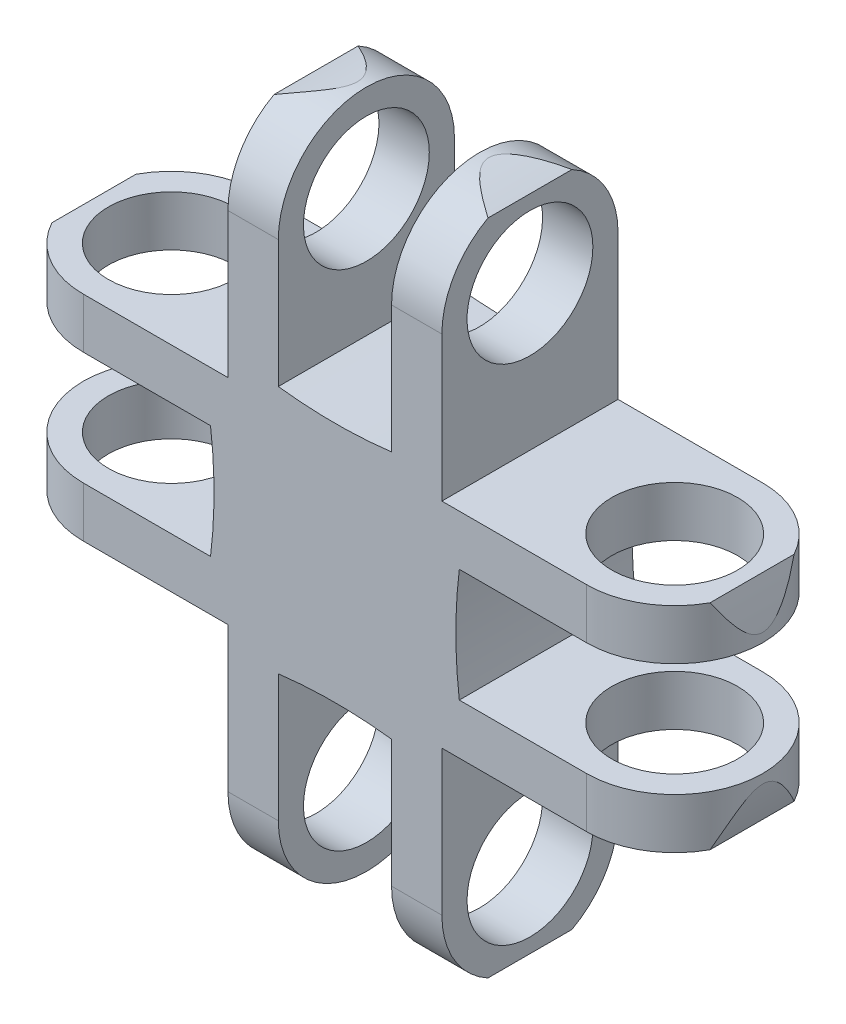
ISO-10303-21;
HEADER;
FILE_DESCRIPTION(('STEP AP214'),'2;1');
FILE_NAME('part.step','',(''),(''),'','','');
FILE_SCHEMA(('AUTOMOTIVE_DESIGN { 1 0 10303 214 1 1 1 1 }'));
ENDSEC;
DATA;
#1=APPLICATION_CONTEXT('core data for automotive mechanical design processes');
#2=APPLICATION_PROTOCOL_DEFINITION('international standard','automotive_design',2000,#1);
#3=PRODUCT_CONTEXT('',#1,'mechanical');
#4=PRODUCT('Part','Part','',(#3));
#5=PRODUCT_RELATED_PRODUCT_CATEGORY('part','',(#4));
#6=PRODUCT_DEFINITION_FORMATION('','',#4);
#7=PRODUCT_DEFINITION_CONTEXT('part definition',#1,'design');
#8=PRODUCT_DEFINITION('design','',#6,#7);
#9=PRODUCT_DEFINITION_SHAPE('','',#8);
#10=(LENGTH_UNIT() NAMED_UNIT(*) SI_UNIT(.MILLI.,.METRE.));
#11=(NAMED_UNIT(*) PLANE_ANGLE_UNIT() SI_UNIT($,.RADIAN.));
#12=(NAMED_UNIT(*) SI_UNIT($,.STERADIAN.) SOLID_ANGLE_UNIT());
#13=UNCERTAINTY_MEASURE_WITH_UNIT(LENGTH_MEASURE(1.E-05),#10,'distance_accuracy_value','');
#14=(GEOMETRIC_REPRESENTATION_CONTEXT(3) GLOBAL_UNCERTAINTY_ASSIGNED_CONTEXT((#13)) GLOBAL_UNIT_ASSIGNED_CONTEXT((#10,
#11,#12)) REPRESENTATION_CONTEXT('',''));
#15=CARTESIAN_POINT('',(0.,0.,0.));
#16=DIRECTION('',(0.,0.,1.));
#17=DIRECTION('',(1.,0.,0.));
#18=AXIS2_PLACEMENT_3D('',#15,#16,#17);
#19=CARTESIAN_POINT('',(0.,8.5,14.));
#20=DIRECTION('',(0.,1.,0.));
#21=DIRECTION('',(0.,0.,1.));
#22=AXIS2_PLACEMENT_3D('',#19,#20,#21);
#23=PLANE('',#22);
#24=CARTESIAN_POINT('',(-20.,8.5,7.));
#25=DIRECTION('',(0.,1.,0.));
#26=DIRECTION('',(0.,0.,1.));
#27=AXIS2_PLACEMENT_3D('',#24,#25,#26);
#28=CIRCLE('',#27,5.);
#29=CARTESIAN_POINT('',(-20.,8.5,12.));
#30=VERTEX_POINT('',#29);
#31=EDGE_CURVE('E839',#30,#30,#28,.T.);
#32=ORIENTED_EDGE('',*,*,#31,.F.);
#33=EDGE_LOOP('',(#32));
#34=FACE_BOUND('',#33,.T.);
#35=DIRECTION('',(1.,0.,0.));
#36=VECTOR('',#35,1.);
#37=CARTESIAN_POINT('',(0.,8.5,0.));
#38=LINE('',#37,#36);
#39=CARTESIAN_POINT('',(-20.,8.5,0.));
#40=VERTEX_POINT('',#39);
#41=CARTESIAN_POINT('',(-8.5,8.5,0.));
#42=VERTEX_POINT('',#41);
#43=EDGE_CURVE('E427',#40,#42,#38,.T.);
#44=ORIENTED_EDGE('',*,*,#43,.F.);
#45=CARTESIAN_POINT('',(-20.,8.5,7.));
#46=DIRECTION('',(0.,1.,0.));
#47=DIRECTION('',(0.,0.,1.));
#48=AXIS2_PLACEMENT_3D('',#45,#46,#47);
#49=CIRCLE('',#48,7.);
#50=CARTESIAN_POINT('',(-26.153393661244,8.5,3.66297341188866));
#51=VERTEX_POINT('',#50);
#52=EDGE_CURVE('E58',#40,#51,#49,.T.);
#53=ORIENTED_EDGE('',*,*,#52,.T.);
#54=DIRECTION('',(0.,0.,-1.));
#55=VECTOR('',#54,1.);
#56=CARTESIAN_POINT('',(-26.153393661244,8.5,14.));
#57=LINE('',#56,#55);
#58=CARTESIAN_POINT('',(-26.153393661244,8.5,10.3370265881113));
#59=VERTEX_POINT('',#58);
#60=EDGE_CURVE('E388',#59,#51,#57,.T.);
#61=ORIENTED_EDGE('',*,*,#60,.F.);
#62=CARTESIAN_POINT('',(-20.,8.5,14.));
#63=VERTEX_POINT('',#62);
#64=EDGE_CURVE('E561',#59,#63,#49,.T.);
#65=ORIENTED_EDGE('',*,*,#64,.T.);
#66=DIRECTION('',(1.,0.,0.));
#67=VECTOR('',#66,1.);
#68=CARTESIAN_POINT('',(0.,8.5,14.));
#69=LINE('',#68,#67);
#70=CARTESIAN_POINT('',(-8.5,8.5,14.));
#71=VERTEX_POINT('',#70);
#72=EDGE_CURVE('E736',#63,#71,#69,.T.);
#73=ORIENTED_EDGE('',*,*,#72,.T.);
#74=DIRECTION('',(0.,0.,-1.));
#75=VECTOR('',#74,1.);
#76=CARTESIAN_POINT('',(-8.5,8.5,14.));
#77=LINE('',#76,#75);
#78=EDGE_CURVE('E391',#71,#42,#77,.T.);
#79=ORIENTED_EDGE('',*,*,#78,.T.);
#80=EDGE_LOOP('',(#44,#53,#61,#65,#73,#79));
#81=FACE_BOUND('',#80,.T.);
#82=ADVANCED_FACE('F43',(#34,#81),#23,.T.);
#83=CARTESIAN_POINT('',(0.,0.,14.));
#84=DIRECTION('',(0.,0.,-1.));
#85=DIRECTION('',(-1.,0.,0.));
#86=AXIS2_PLACEMENT_3D('',#83,#84,#85);
#87=CYLINDRICAL_SURFACE('',#86,27.5);
#88=CARTESIAN_POINT('',(-26.153393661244,8.5,10.3370265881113));
#89=CARTESIAN_POINT('',(-26.1912836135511,8.38342421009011,10.267142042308));
#90=CARTESIAN_POINT('',(-26.228210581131,8.26714661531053,10.1962248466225));
#91=CARTESIAN_POINT('',(-26.3001329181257,8.03540316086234,10.0520236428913));
#92=CARTESIAN_POINT('',(-26.3351275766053,7.91993761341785,9.97873877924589));
#93=CARTESIAN_POINT('',(-26.4036789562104,7.68833868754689,9.8283955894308));
#94=CARTESIAN_POINT('',(-26.4372049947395,7.57222268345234,9.75129638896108));
#95=CARTESIAN_POINT('',(-26.5021874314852,7.34155381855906,9.59399346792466));
#96=CARTESIAN_POINT('',(-26.5336442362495,7.22700065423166,9.51379036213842));
#97=CARTESIAN_POINT('',(-26.5966385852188,6.99175874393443,9.34375162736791));
#98=CARTESIAN_POINT('',(-26.6280169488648,6.87122656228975,9.25363906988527));
#99=CARTESIAN_POINT('',(-26.6882069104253,6.63359751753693,9.06818718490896));
#100=CARTESIAN_POINT('',(-26.7170190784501,6.51649989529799,8.97284902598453));
#101=CARTESIAN_POINT('',(-26.7716909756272,6.28810464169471,8.77611100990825));
#102=CARTESIAN_POINT('',(-26.7975684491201,6.17677463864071,8.67475393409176));
#103=CARTESIAN_POINT('',(-26.846177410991,5.96194565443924,8.46343006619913));
#104=CARTESIAN_POINT('',(-26.8689138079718,5.85843457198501,8.35347713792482));
#105=CARTESIAN_POINT('',(-26.8967066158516,5.72872682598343,8.19874544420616));
#106=CARTESIAN_POINT('',(-26.9034893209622,5.69677731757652,8.15909665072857));
#107=CARTESIAN_POINT('',(-26.9165659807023,5.63466775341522,8.07832854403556));
#108=CARTESIAN_POINT('',(-26.9228597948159,5.60450821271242,8.03720881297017));
#109=CARTESIAN_POINT('',(-26.9408977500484,5.51738363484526,7.91163990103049));
#110=CARTESIAN_POINT('',(-26.9518344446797,5.46360342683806,7.82478469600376));
#111=CARTESIAN_POINT('',(-26.9710800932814,5.3677994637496,7.64233942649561));
#112=CARTESIAN_POINT('',(-26.9793392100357,5.32600019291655,7.54662215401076));
#113=CARTESIAN_POINT('',(-26.9919974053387,5.26148408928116,7.34878516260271));
#114=CARTESIAN_POINT('',(-26.9964129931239,5.23868565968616,7.24669486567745));
#115=CARTESIAN_POINT('',(-27.0001206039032,5.21953484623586,7.06587682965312));
#116=CARTESIAN_POINT('',(-27.0004203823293,5.21798120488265,6.98771618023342));
#117=CARTESIAN_POINT('',(-26.9984225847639,5.22830801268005,6.83229608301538));
#118=CARTESIAN_POINT('',(-26.9961231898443,5.24019786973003,6.7550373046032));
#119=CARTESIAN_POINT('',(-26.9882680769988,5.28052056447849,6.5837554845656));
#120=CARTESIAN_POINT('',(-26.9820201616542,5.31245581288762,6.49060772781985));
#121=CARTESIAN_POINT('',(-26.9665639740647,5.39036015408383,6.31064253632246));
#122=CARTESIAN_POINT('',(-26.9573477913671,5.43636673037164,6.22384278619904));
#123=CARTESIAN_POINT('',(-26.9374379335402,5.53414311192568,6.06298111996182));
#124=CARTESIAN_POINT('',(-26.9269119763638,5.58519944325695,5.98845288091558));
#125=CARTESIAN_POINT('',(-26.9042786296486,5.69322766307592,5.84402169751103));
#126=CARTESIAN_POINT('',(-26.8921696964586,5.75020531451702,5.7741233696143));
#127=CARTESIAN_POINT('',(-26.8665290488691,5.86884410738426,5.63778677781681));
#128=CARTESIAN_POINT('',(-26.8529872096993,5.93053758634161,5.57137888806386));
#129=CARTESIAN_POINT('',(-26.8247305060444,6.05706521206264,5.44197782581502));
#130=CARTESIAN_POINT('',(-26.8100161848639,6.12189789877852,5.37898309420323));
#131=CARTESIAN_POINT('',(-26.7740007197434,6.27784915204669,5.23353732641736));
#132=CARTESIAN_POINT('',(-26.7522432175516,6.36998804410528,5.15229721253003));
#133=CARTESIAN_POINT('',(-26.7069243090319,6.55740176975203,4.99402798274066));
#134=CARTESIAN_POINT('',(-26.6833623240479,6.65267760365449,4.91700023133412));
#135=CARTESIAN_POINT('',(-26.610059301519,6.94221325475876,4.69080814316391));
#136=CARTESIAN_POINT('',(-26.5577730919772,7.13986699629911,4.54681599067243));
#137=CARTESIAN_POINT('',(-26.4496370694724,7.53032592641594,4.27560302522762));
#138=CARTESIAN_POINT('',(-26.3940901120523,7.72288960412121,4.14790533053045));
#139=CARTESIAN_POINT('',(-26.3067423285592,8.01345656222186,3.96196562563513));
#140=CARTESIAN_POINT('',(-26.2770244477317,8.11038554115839,3.90104718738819));
#141=CARTESIAN_POINT('',(-26.2162281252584,8.3048035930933,3.78083282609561));
#142=CARTESIAN_POINT('',(-26.1851498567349,8.40229259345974,3.72153669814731));
#143=CARTESIAN_POINT('',(-26.153393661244,8.5,3.66297341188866));
#144=B_SPLINE_CURVE_WITH_KNOTS('',3,(#88,#89,#90,#91,#92,#93,#94,#95,#96,#97,#98,#99,#100,#101,
#102,#103,#104,#105,#106,#107,#108,#109,#110,#111,#112,#113,#114,#115,#116,#117,#118,#119,#120,
#121,#122,#123,#124,#125,#126,#127,#128,#129,#130,#131,#132,#133,#134,#135,#136,#137,#138,#139,
#140,#141,#142,#143),.UNSPECIFIED.,.F.,.F.,(4,2,2,2,2,2,2,2,2,2,2,2,2,2,2,2,2,2,2,2,2,2,2,2,2,2,
2,4),(0.,0.423304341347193,0.846763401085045,1.27678391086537,1.70671967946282,2.16779596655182,
2.6287695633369,3.08678777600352,3.54408193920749,3.69814162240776,3.85224542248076,
4.15967136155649,4.47252852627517,4.7840351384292,5.01736140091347,5.2508510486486,
5.54516052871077,5.84026092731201,6.11270911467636,6.385424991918,6.66021594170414,
6.93488029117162,7.30896287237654,7.68316591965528,8.43285158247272,9.14557010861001,
9.50038272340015,9.85515031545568),.UNSPECIFIED.);
#145=EDGE_CURVE('E554',#59,#51,#144,.T.);
#146=ORIENTED_EDGE('',*,*,#145,.F.);
#147=ORIENTED_EDGE('',*,*,#60,.T.);
#148=EDGE_LOOP('',(#146,#147));
#149=FACE_BOUND('',#148,.T.);
#150=ADVANCED_FACE('F541',(#149),#87,.T.);
#151=CARTESIAN_POINT('',(0.,4.5,14.));
#152=DIRECTION('',(0.,-1.,0.));
#153=DIRECTION('',(1.,0.,0.));
#154=AXIS2_PLACEMENT_3D('',#151,#152,#153);
#155=PLANE('',#154);
#156=CARTESIAN_POINT('',(-20.,4.5,7.));
#157=DIRECTION('',(0.,-1.,0.));
#158=DIRECTION('',(1.,0.,0.));
#159=AXIS2_PLACEMENT_3D('',#156,#157,#158);
#160=CIRCLE('',#159,5.);
#161=CARTESIAN_POINT('',(-15.,4.5,7.));
#162=VERTEX_POINT('',#161);
#163=EDGE_CURVE('E848',#162,#162,#160,.T.);
#164=ORIENTED_EDGE('',*,*,#163,.F.);
#165=EDGE_LOOP('',(#164));
#166=FACE_BOUND('',#165,.T.);
#167=DIRECTION('',(-1.,0.,0.));
#168=VECTOR('',#167,1.);
#169=CARTESIAN_POINT('',(0.,4.5,14.));
#170=LINE('',#169,#168);
#171=CARTESIAN_POINT('',(-9.88482277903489,4.5,14.));
#172=VERTEX_POINT('',#171);
#173=CARTESIAN_POINT('',(-20.,4.5,14.));
#174=VERTEX_POINT('',#173);
#175=EDGE_CURVE('E614',#172,#174,#170,.T.);
#176=ORIENTED_EDGE('',*,*,#175,.T.);
#177=CARTESIAN_POINT('',(-20.,4.5,7.));
#178=DIRECTION('',(0.,-1.,0.));
#179=DIRECTION('',(1.,0.,0.));
#180=AXIS2_PLACEMENT_3D('',#177,#178,#179);
#181=CIRCLE('',#180,7.);
#182=CARTESIAN_POINT('',(-20.,4.5,0.));
#183=VERTEX_POINT('',#182);
#184=EDGE_CURVE('E562',#174,#183,#181,.T.);
#185=ORIENTED_EDGE('',*,*,#184,.T.);
#186=DIRECTION('',(-1.,0.,0.));
#187=VECTOR('',#186,1.);
#188=CARTESIAN_POINT('',(0.,4.5,0.));
#189=LINE('',#188,#187);
#190=CARTESIAN_POINT('',(-9.88482277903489,4.5,0.));
#191=VERTEX_POINT('',#190);
#192=EDGE_CURVE('E431',#191,#183,#189,.T.);
#193=ORIENTED_EDGE('',*,*,#192,.F.);
#194=DIRECTION('',(0.,0.,-1.));
#195=VECTOR('',#194,1.);
#196=CARTESIAN_POINT('',(-9.88482277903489,4.5,14.));
#197=LINE('',#196,#195);
#198=EDGE_CURVE('E385',#172,#191,#197,.T.);
#199=ORIENTED_EDGE('',*,*,#198,.F.);
#200=EDGE_LOOP('',(#176,#185,#193,#199));
#201=FACE_BOUND('',#200,.T.);
#202=ADVANCED_FACE('F546',(#166,#201),#155,.T.);
#203=CARTESIAN_POINT('',(0.,-4.5,14.));
#204=DIRECTION('',(0.,1.,0.));
#205=DIRECTION('',(-1.,0.,0.));
#206=AXIS2_PLACEMENT_3D('',#203,#204,#205);
#207=PLANE('',#206);
#208=CARTESIAN_POINT('',(-20.,-4.5,7.));
#209=DIRECTION('',(0.,1.,0.));
#210=DIRECTION('',(-1.,0.,0.));
#211=AXIS2_PLACEMENT_3D('',#208,#209,#210);
#212=CIRCLE('',#211,5.);
#213=CARTESIAN_POINT('',(-25.,-4.5,7.));
#214=VERTEX_POINT('',#213);
#215=EDGE_CURVE('E414',#214,#214,#212,.T.);
#216=ORIENTED_EDGE('',*,*,#215,.F.);
#217=EDGE_LOOP('',(#216));
#218=FACE_BOUND('',#217,.T.);
#219=DIRECTION('',(1.,0.,0.));
#220=VECTOR('',#219,1.);
#221=CARTESIAN_POINT('',(0.,-4.5,0.));
#222=LINE('',#221,#220);
#223=CARTESIAN_POINT('',(-20.,-4.5,0.));
#224=VERTEX_POINT('',#223);
#225=CARTESIAN_POINT('',(-9.88482277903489,-4.5,0.));
#226=VERTEX_POINT('',#225);
#227=EDGE_CURVE('E450',#224,#226,#222,.T.);
#228=ORIENTED_EDGE('',*,*,#227,.F.);
#229=CARTESIAN_POINT('',(-20.,-4.5,7.));
#230=DIRECTION('',(0.,1.,0.));
#231=DIRECTION('',(-1.,0.,0.));
#232=AXIS2_PLACEMENT_3D('',#229,#230,#231);
#233=CIRCLE('',#232,7.);
#234=CARTESIAN_POINT('',(-20.,-4.5,14.));
#235=VERTEX_POINT('',#234);
#236=EDGE_CURVE('E66',#224,#235,#233,.T.);
#237=ORIENTED_EDGE('',*,*,#236,.T.);
#238=DIRECTION('',(1.,0.,0.));
#239=VECTOR('',#238,1.);
#240=CARTESIAN_POINT('',(0.,-4.5,14.));
#241=LINE('',#240,#239);
#242=CARTESIAN_POINT('',(-9.88482277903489,-4.5,14.));
#243=VERTEX_POINT('',#242);
#244=EDGE_CURVE('E667',#235,#243,#241,.T.);
#245=ORIENTED_EDGE('',*,*,#244,.T.);
#246=DIRECTION('',(0.,0.,-1.));
#247=VECTOR('',#246,1.);
#248=CARTESIAN_POINT('',(-9.88482277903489,-4.5,14.));
#249=LINE('',#248,#247);
#250=EDGE_CURVE('E382',#243,#226,#249,.T.);
#251=ORIENTED_EDGE('',*,*,#250,.T.);
#252=EDGE_LOOP('',(#228,#237,#245,#251));
#253=FACE_BOUND('',#252,.T.);
#254=ADVANCED_FACE('F590',(#218,#253),#207,.T.);
#255=CARTESIAN_POINT('',(0.,0.,14.));
#256=DIRECTION('',(0.,0.,-1.));
#257=DIRECTION('',(-1.,0.,0.));
#258=AXIS2_PLACEMENT_3D('',#255,#256,#257);
#259=CYLINDRICAL_SURFACE('',#258,27.5);
#260=CARTESIAN_POINT('',(-26.153393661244,-8.5,3.66297341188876));
#261=CARTESIAN_POINT('',(-26.1912836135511,-8.38342421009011,3.73285795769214));
#262=CARTESIAN_POINT('',(-26.228210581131,-8.26714661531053,3.8037751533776));
#263=CARTESIAN_POINT('',(-26.3001329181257,-8.03540316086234,3.94797635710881));
#264=CARTESIAN_POINT('',(-26.3351275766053,-7.91993761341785,4.02126122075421));
#265=CARTESIAN_POINT('',(-26.4036789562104,-7.68833868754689,4.17160441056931));
#266=CARTESIAN_POINT('',(-26.4372049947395,-7.57222268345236,4.24870361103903));
#267=CARTESIAN_POINT('',(-26.5021874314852,-7.34155381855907,4.40600653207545));
#268=CARTESIAN_POINT('',(-26.5336442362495,-7.22700065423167,4.48620963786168));
#269=CARTESIAN_POINT('',(-26.5966385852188,-6.99175874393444,4.65624837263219));
#270=CARTESIAN_POINT('',(-26.6280169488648,-6.87122656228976,4.74636093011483));
#271=CARTESIAN_POINT('',(-26.6882069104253,-6.63359751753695,4.93181281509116));
#272=CARTESIAN_POINT('',(-26.7170190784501,-6.51649989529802,5.02715097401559));
#273=CARTESIAN_POINT('',(-26.7716909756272,-6.28810464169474,5.22388899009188));
#274=CARTESIAN_POINT('',(-26.7975684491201,-6.17677463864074,5.32524606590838));
#275=CARTESIAN_POINT('',(-26.846177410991,-5.96194565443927,5.53656993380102));
#276=CARTESIAN_POINT('',(-26.8689138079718,-5.85843457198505,5.64652286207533));
#277=CARTESIAN_POINT('',(-26.8967066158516,-5.72872682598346,5.801254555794));
#278=CARTESIAN_POINT('',(-26.9034893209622,-5.69677731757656,5.84090334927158));
#279=CARTESIAN_POINT('',(-26.9165659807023,-5.63466775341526,5.92167145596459));
#280=CARTESIAN_POINT('',(-26.9228597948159,-5.60450821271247,5.96279118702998));
#281=CARTESIAN_POINT('',(-26.9408977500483,-5.51738363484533,6.08836009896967));
#282=CARTESIAN_POINT('',(-26.9518344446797,-5.46360342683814,6.17521530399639));
#283=CARTESIAN_POINT('',(-26.9710800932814,-5.3677994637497,6.35766057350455));
#284=CARTESIAN_POINT('',(-26.9793392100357,-5.32600019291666,6.45337784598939));
#285=CARTESIAN_POINT('',(-26.9919974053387,-5.26148408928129,6.65121483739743));
#286=CARTESIAN_POINT('',(-26.9964129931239,-5.23868565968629,6.75330513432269));
#287=CARTESIAN_POINT('',(-27.0001206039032,-5.21953484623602,6.93412317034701));
#288=CARTESIAN_POINT('',(-27.0004203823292,-5.21798120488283,7.01228381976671));
#289=CARTESIAN_POINT('',(-26.9984225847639,-5.22830801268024,7.16770391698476));
#290=CARTESIAN_POINT('',(-26.9961231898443,-5.24019786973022,7.24496269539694));
#291=CARTESIAN_POINT('',(-26.9882680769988,-5.28052056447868,7.41624451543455));
#292=CARTESIAN_POINT('',(-26.9820201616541,-5.31245581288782,7.50939227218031));
#293=CARTESIAN_POINT('',(-26.9665639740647,-5.39036015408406,7.68935746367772));
#294=CARTESIAN_POINT('',(-26.957347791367,-5.4363667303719,7.77615721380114));
#295=CARTESIAN_POINT('',(-26.9374379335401,-5.53414311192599,7.93701888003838));
#296=CARTESIAN_POINT('',(-26.9269119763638,-5.58519944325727,8.01154711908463));
#297=CARTESIAN_POINT('',(-26.9042786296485,-5.69322766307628,8.1559783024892));
#298=CARTESIAN_POINT('',(-26.8921696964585,-5.75020531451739,8.22587663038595));
#299=CARTESIAN_POINT('',(-26.866529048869,-5.86884410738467,8.36221322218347));
#300=CARTESIAN_POINT('',(-26.8529872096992,-5.93053758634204,8.42862111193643));
#301=CARTESIAN_POINT('',(-26.8247305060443,-6.0570652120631,8.55802217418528));
#302=CARTESIAN_POINT('',(-26.8100161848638,-6.121897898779,8.62101690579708));
#303=CARTESIAN_POINT('',(-26.7740007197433,-6.27784915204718,8.76646267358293));
#304=CARTESIAN_POINT('',(-26.7522432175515,-6.36998804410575,8.84770278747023));
#305=CARTESIAN_POINT('',(-26.7069243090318,-6.55740176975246,9.00597201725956));
#306=CARTESIAN_POINT('',(-26.6833623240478,-6.65267760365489,9.08299976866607));
#307=CARTESIAN_POINT('',(-26.6100593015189,-6.94221325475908,9.30919185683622));
#308=CARTESIAN_POINT('',(-26.5577730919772,-7.13986699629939,9.45318400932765));
#309=CARTESIAN_POINT('',(-26.4496370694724,-7.53032592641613,9.72439697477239));
#310=CARTESIAN_POINT('',(-26.3940901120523,-7.72288960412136,9.85209466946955));
#311=CARTESIAN_POINT('',(-26.3067423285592,-8.01345656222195,10.0380343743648));
#312=CARTESIAN_POINT('',(-26.2770244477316,-8.11038554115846,10.0989528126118));
#313=CARTESIAN_POINT('',(-26.2162281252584,-8.30480359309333,10.2191671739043));
#314=CARTESIAN_POINT('',(-26.1851498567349,-8.40229259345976,10.2784633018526));
#315=CARTESIAN_POINT('',(-26.153393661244,-8.5,10.3370265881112));
#316=B_SPLINE_CURVE_WITH_KNOTS('',3,(#260,#261,#262,#263,#264,#265,#266,#267,#268,#269,#270,
#271,#272,#273,#274,#275,#276,#277,#278,#279,#280,#281,#282,#283,#284,#285,#286,#287,#288,#289,
#290,#291,#292,#293,#294,#295,#296,#297,#298,#299,#300,#301,#302,#303,#304,#305,#306,#307,#308,
#309,#310,#311,#312,#313,#314,#315),.UNSPECIFIED.,.F.,.F.,(4,2,2,2,2,2,2,2,2,2,2,2,2,2,2,2,2,2,
2,2,2,2,2,2,2,2,2,4),(0.,0.423304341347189,0.846763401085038,1.27678391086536,1.7067196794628,
2.16779596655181,2.62876956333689,3.08678777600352,3.5440819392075,3.69814162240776,
3.85224542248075,4.15967136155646,4.47252852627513,4.78403513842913,5.01736140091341,
5.25085104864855,5.54516052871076,5.84026092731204,6.11270911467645,6.38542499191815,
6.66021594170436,6.9348802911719,7.30896287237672,7.68316591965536,8.4328515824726,
9.14557010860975,9.50038272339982,9.85515031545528),.UNSPECIFIED.);
#317=CARTESIAN_POINT('',(-26.153393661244,-8.49999999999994,3.66297341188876));
#318=VERTEX_POINT('',#317);
#319=CARTESIAN_POINT('',(-26.153393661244,-8.5,10.3370265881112));
#320=VERTEX_POINT('',#319);
#321=EDGE_CURVE('E574',#318,#320,#316,.T.);
#322=ORIENTED_EDGE('',*,*,#321,.F.);
#323=DIRECTION('',(0.,0.,-1.));
#324=VECTOR('',#323,1.);
#325=CARTESIAN_POINT('',(-26.153393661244,-8.5,14.));
#326=LINE('',#325,#324);
#327=EDGE_CURVE('E379',#320,#318,#326,.T.);
#328=ORIENTED_EDGE('',*,*,#327,.F.);
#329=EDGE_LOOP('',(#322,#328));
#330=FACE_BOUND('',#329,.T.);
#331=ADVANCED_FACE('F584',(#330),#259,.T.);
#332=CARTESIAN_POINT('',(0.,-8.50000000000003,14.));
#333=DIRECTION('',(0.,-1.,0.));
#334=DIRECTION('',(1.,0.,0.));
#335=AXIS2_PLACEMENT_3D('',#332,#333,#334);
#336=PLANE('',#335);
#337=CARTESIAN_POINT('',(-20.,-8.49999999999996,7.));
#338=DIRECTION('',(0.,-1.,0.));
#339=DIRECTION('',(1.,0.,0.));
#340=AXIS2_PLACEMENT_3D('',#337,#338,#339);
#341=CIRCLE('',#340,5.);
#342=CARTESIAN_POINT('',(-15.,-8.49999999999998,7.));
#343=VERTEX_POINT('',#342);
#344=EDGE_CURVE('E412',#343,#343,#341,.T.);
#345=ORIENTED_EDGE('',*,*,#344,.F.);
#346=EDGE_LOOP('',(#345));
#347=FACE_BOUND('',#346,.T.);
#348=DIRECTION('',(-1.,0.,0.));
#349=VECTOR('',#348,1.);
#350=CARTESIAN_POINT('',(0.,-8.50000000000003,14.));
#351=LINE('',#350,#349);
#352=CARTESIAN_POINT('',(-8.5,-8.5,14.));
#353=VERTEX_POINT('',#352);
#354=CARTESIAN_POINT('',(-20.,-8.5,14.));
#355=VERTEX_POINT('',#354);
#356=EDGE_CURVE('E660',#353,#355,#351,.T.);
#357=ORIENTED_EDGE('',*,*,#356,.T.);
#358=CARTESIAN_POINT('',(-20.,-8.49999999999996,7.));
#359=DIRECTION('',(0.,-1.,0.));
#360=DIRECTION('',(1.,0.,0.));
#361=AXIS2_PLACEMENT_3D('',#358,#359,#360);
#362=CIRCLE('',#361,7.);
#363=EDGE_CURVE('E581',#355,#320,#362,.T.);
#364=ORIENTED_EDGE('',*,*,#363,.T.);
#365=ORIENTED_EDGE('',*,*,#327,.T.);
#366=CARTESIAN_POINT('',(-20.,-8.5,0.));
#367=VERTEX_POINT('',#366);
#368=EDGE_CURVE('E582',#318,#367,#362,.T.);
#369=ORIENTED_EDGE('',*,*,#368,.T.);
#370=DIRECTION('',(-1.,0.,0.));
#371=VECTOR('',#370,1.);
#372=CARTESIAN_POINT('',(0.,-8.50000000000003,0.));
#373=LINE('',#372,#371);
#374=CARTESIAN_POINT('',(-8.5,-8.5,0.));
#375=VERTEX_POINT('',#374);
#376=EDGE_CURVE('E452',#375,#367,#373,.T.);
#377=ORIENTED_EDGE('',*,*,#376,.F.);
#378=DIRECTION('',(0.,0.,-1.));
#379=VECTOR('',#378,1.);
#380=CARTESIAN_POINT('',(-8.5,-8.5,14.));
#381=LINE('',#380,#379);
#382=EDGE_CURVE('E376',#353,#375,#381,.T.);
#383=ORIENTED_EDGE('',*,*,#382,.F.);
#384=EDGE_LOOP('',(#357,#364,#365,#369,#377,#383));
#385=FACE_BOUND('',#384,.T.);
#386=ADVANCED_FACE('F589',(#347,#385),#336,.T.);
#387=CARTESIAN_POINT('',(-8.5,0.,14.));
#388=DIRECTION('',(-1.,0.,0.));
#389=DIRECTION('',(0.,0.,1.));
#390=AXIS2_PLACEMENT_3D('',#387,#388,#389);
#391=PLANE('',#390);
#392=CARTESIAN_POINT('',(-8.5,-20.,7.));
#393=DIRECTION('',(-1.,0.,0.));
#394=DIRECTION('',(0.,0.,1.));
#395=AXIS2_PLACEMENT_3D('',#392,#393,#394);
#396=CIRCLE('',#395,5.);
#397=CARTESIAN_POINT('',(-8.5,-20.,12.));
#398=VERTEX_POINT('',#397);
#399=EDGE_CURVE('E415',#398,#398,#396,.T.);
#400=ORIENTED_EDGE('',*,*,#399,.F.);
#401=EDGE_LOOP('',(#400));
#402=FACE_BOUND('',#401,.T.);
#403=DIRECTION('',(0.,1.,0.));
#404=VECTOR('',#403,1.);
#405=CARTESIAN_POINT('',(-8.5,0.,0.));
#406=LINE('',#405,#404);
#407=CARTESIAN_POINT('',(-8.5,-20.,0.));
#408=VERTEX_POINT('',#407);
#409=EDGE_CURVE('E454',#408,#375,#406,.T.);
#410=ORIENTED_EDGE('',*,*,#409,.F.);
#411=CARTESIAN_POINT('',(-8.5,-20.,7.));
#412=DIRECTION('',(-1.,0.,0.));
#413=DIRECTION('',(0.,0.,1.));
#414=AXIS2_PLACEMENT_3D('',#411,#412,#413);
#415=CIRCLE('',#414,7.);
#416=CARTESIAN_POINT('',(-8.49999999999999,-26.153393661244,3.66297341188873));
#417=VERTEX_POINT('',#416);
#418=EDGE_CURVE('E626',#408,#417,#415,.T.);
#419=ORIENTED_EDGE('',*,*,#418,.T.);
#420=DIRECTION('',(0.,0.,-1.));
#421=VECTOR('',#420,1.);
#422=CARTESIAN_POINT('',(-8.5,-26.153393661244,14.));
#423=LINE('',#422,#421);
#424=CARTESIAN_POINT('',(-8.49999999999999,-26.153393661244,10.3370265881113));
#425=VERTEX_POINT('',#424);
#426=EDGE_CURVE('E373',#425,#417,#423,.T.);
#427=ORIENTED_EDGE('',*,*,#426,.F.);
#428=CARTESIAN_POINT('',(-8.5,-20.,14.));
#429=VERTEX_POINT('',#428);
#430=EDGE_CURVE('E629',#425,#429,#415,.T.);
#431=ORIENTED_EDGE('',*,*,#430,.T.);
#432=DIRECTION('',(0.,1.,0.));
#433=VECTOR('',#432,1.);
#434=CARTESIAN_POINT('',(-8.5,0.,14.));
#435=LINE('',#434,#433);
#436=EDGE_CURVE('E666',#429,#353,#435,.T.);
#437=ORIENTED_EDGE('',*,*,#436,.T.);
#438=ORIENTED_EDGE('',*,*,#382,.T.);
#439=EDGE_LOOP('',(#410,#419,#427,#431,#437,#438));
#440=FACE_BOUND('',#439,.T.);
#441=ADVANCED_FACE('F648',(#402,#440),#391,.T.);
#442=CARTESIAN_POINT('',(0.,0.,14.));
#443=DIRECTION('',(0.,0.,-1.));
#444=DIRECTION('',(-1.,0.,0.));
#445=AXIS2_PLACEMENT_3D('',#442,#443,#444);
#446=CYLINDRICAL_SURFACE('',#445,27.5);
#447=CARTESIAN_POINT('',(-8.49999999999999,-26.153393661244,10.3370265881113));
#448=CARTESIAN_POINT('',(-8.38342421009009,-26.1912836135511,10.2671420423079));
#449=CARTESIAN_POINT('',(-8.26714661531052,-26.228210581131,10.1962248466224));
#450=CARTESIAN_POINT('',(-8.03540316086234,-26.3001329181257,10.0520236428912));
#451=CARTESIAN_POINT('',(-7.91993761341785,-26.3351275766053,9.97873877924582));
#452=CARTESIAN_POINT('',(-7.68833868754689,-26.4036789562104,9.82839558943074));
#453=CARTESIAN_POINT('',(-7.57222268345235,-26.4372049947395,9.75129638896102));
#454=CARTESIAN_POINT('',(-7.34155381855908,-26.5021874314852,9.5939934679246));
#455=CARTESIAN_POINT('',(-7.22700065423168,-26.5336442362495,9.51379036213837));
#456=CARTESIAN_POINT('',(-6.99175874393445,-26.5966385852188,9.34375162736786));
#457=CARTESIAN_POINT('',(-6.87122656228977,-26.6280169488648,9.25363906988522));
#458=CARTESIAN_POINT('',(-6.63359751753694,-26.6882069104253,9.0681871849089));
#459=CARTESIAN_POINT('',(-6.51649989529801,-26.7170190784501,8.97284902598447));
#460=CARTESIAN_POINT('',(-6.28810464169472,-26.7716909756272,8.77611100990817));
#461=CARTESIAN_POINT('',(-6.17677463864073,-26.7975684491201,8.67475393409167));
#462=CARTESIAN_POINT('',(-5.96194565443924,-26.846177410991,8.46343006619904));
#463=CARTESIAN_POINT('',(-5.85843457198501,-26.8689138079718,8.35347713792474));
#464=CARTESIAN_POINT('',(-5.72872682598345,-26.8967066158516,8.19874544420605));
#465=CARTESIAN_POINT('',(-5.69677731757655,-26.9034893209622,8.15909665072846));
#466=CARTESIAN_POINT('',(-5.63466775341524,-26.9165659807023,8.07832854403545));
#467=CARTESIAN_POINT('',(-5.60450821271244,-26.9228597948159,8.03720881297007));
#468=CARTESIAN_POINT('',(-5.51738363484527,-26.9408977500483,7.9116399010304));
#469=CARTESIAN_POINT('',(-5.46360342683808,-26.9518344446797,7.82478469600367));
#470=CARTESIAN_POINT('',(-5.36779946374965,-26.9710800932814,7.64233942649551));
#471=CARTESIAN_POINT('',(-5.32600019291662,-26.9793392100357,7.54662215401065));
#472=CARTESIAN_POINT('',(-5.26148408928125,-26.9919974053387,7.34878516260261));
#473=CARTESIAN_POINT('',(-5.23868565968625,-26.9964129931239,7.24669486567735));
#474=CARTESIAN_POINT('',(-5.21953484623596,-27.0001206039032,7.06587682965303));
#475=CARTESIAN_POINT('',(-5.21798120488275,-27.0004203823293,6.98771618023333));
#476=CARTESIAN_POINT('',(-5.22830801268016,-26.9984225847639,6.83229608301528));
#477=CARTESIAN_POINT('',(-5.24019786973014,-26.9961231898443,6.75503730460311));
#478=CARTESIAN_POINT('',(-5.28052056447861,-26.9882680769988,6.5837554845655));
#479=CARTESIAN_POINT('',(-5.31245581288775,-26.9820201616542,6.49060772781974));
#480=CARTESIAN_POINT('',(-5.39036015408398,-26.9665639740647,6.31064253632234));
#481=CARTESIAN_POINT('',(-5.4363667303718,-26.957347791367,6.22384278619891));
#482=CARTESIAN_POINT('',(-5.53414311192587,-26.9374379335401,6.06298111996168));
#483=CARTESIAN_POINT('',(-5.58519944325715,-26.9269119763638,5.98845288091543));
#484=CARTESIAN_POINT('',(-5.69322766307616,-26.9042786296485,5.84402169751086));
#485=CARTESIAN_POINT('',(-5.75020531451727,-26.8921696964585,5.77412336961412));
#486=CARTESIAN_POINT('',(-5.86884410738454,-26.866529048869,5.63778677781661));
#487=CARTESIAN_POINT('',(-5.93053758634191,-26.8529872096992,5.57137888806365));
#488=CARTESIAN_POINT('',(-6.05706521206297,-26.8247305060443,5.4419778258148));
#489=CARTESIAN_POINT('',(-6.12189789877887,-26.8100161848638,5.37898309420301));
#490=CARTESIAN_POINT('',(-6.27784915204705,-26.7740007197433,5.23353732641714));
#491=CARTESIAN_POINT('',(-6.36998804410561,-26.7522432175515,5.15229721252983));
#492=CARTESIAN_POINT('',(-6.55740176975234,-26.7069243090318,4.99402798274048));
#493=CARTESIAN_POINT('',(-6.65267760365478,-26.6833623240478,4.91700023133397));
#494=CARTESIAN_POINT('',(-6.942213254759,-26.6100593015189,4.69080814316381));
#495=CARTESIAN_POINT('',(-7.13986699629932,-26.5577730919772,4.54681599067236));
#496=CARTESIAN_POINT('',(-7.53032592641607,-26.4496370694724,4.2756030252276));
#497=CARTESIAN_POINT('',(-7.72288960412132,-26.3940901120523,4.14790533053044));
#498=CARTESIAN_POINT('',(-8.01345656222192,-26.3067423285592,3.96196562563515));
#499=CARTESIAN_POINT('',(-8.11038554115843,-26.2770244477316,3.90104718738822));
#500=CARTESIAN_POINT('',(-8.30480359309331,-26.2162281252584,3.78083282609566));
#501=CARTESIAN_POINT('',(-8.40229259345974,-26.1851498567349,3.72153669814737));
#502=CARTESIAN_POINT('',(-8.49999999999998,-26.153393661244,3.66297341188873));
#503=B_SPLINE_CURVE_WITH_KNOTS('',3,(#447,#448,#449,#450,#451,#452,#453,#454,#455,#456,#457,
#458,#459,#460,#461,#462,#463,#464,#465,#466,#467,#468,#469,#470,#471,#472,#473,#474,#475,#476,
#477,#478,#479,#480,#481,#482,#483,#484,#485,#486,#487,#488,#489,#490,#491,#492,#493,#494,#495,
#496,#497,#498,#499,#500,#501,#502),.UNSPECIFIED.,.F.,.F.,(4,2,2,2,2,2,2,2,2,2,2,2,2,2,2,2,2,2,
2,2,2,2,2,2,2,2,2,4),(0.,0.423304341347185,0.846763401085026,1.27678391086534,1.70671967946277,
2.16779596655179,2.62876956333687,3.08678777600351,3.5440819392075,3.69814162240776,
3.85224542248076,4.15967136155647,4.47252852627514,4.78403513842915,5.01736140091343,
5.25085104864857,5.54516052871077,5.84026092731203,6.11270911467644,6.38542499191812,
6.66021594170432,6.93488029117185,7.3089628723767,7.68316591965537,8.43285158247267,
9.14557010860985,9.50038272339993,9.8551503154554),.UNSPECIFIED.);
#504=EDGE_CURVE('E633',#425,#417,#503,.T.);
#505=ORIENTED_EDGE('',*,*,#504,.F.);
#506=ORIENTED_EDGE('',*,*,#426,.T.);
#507=EDGE_LOOP('',(#505,#506));
#508=FACE_BOUND('',#507,.T.);
#509=ADVANCED_FACE('F643',(#508),#446,.T.);
#510=CARTESIAN_POINT('',(-4.5,0.,14.));
#511=DIRECTION('',(1.,0.,0.));
#512=DIRECTION('',(0.,0.,-1.));
#513=AXIS2_PLACEMENT_3D('',#510,#511,#512);
#514=PLANE('',#513);
#515=CARTESIAN_POINT('',(-4.5,-20.,7.));
#516=DIRECTION('',(1.,0.,0.));
#517=DIRECTION('',(0.,0.,-1.));
#518=AXIS2_PLACEMENT_3D('',#515,#516,#517);
#519=CIRCLE('',#518,5.);
#520=CARTESIAN_POINT('',(-4.5,-20.,2.));
#521=VERTEX_POINT('',#520);
#522=EDGE_CURVE('E856',#521,#521,#519,.T.);
#523=ORIENTED_EDGE('',*,*,#522,.F.);
#524=EDGE_LOOP('',(#523));
#525=FACE_BOUND('',#524,.T.);
#526=DIRECTION('',(0.,-1.,0.));
#527=VECTOR('',#526,1.);
#528=CARTESIAN_POINT('',(-4.5,0.,14.));
#529=LINE('',#528,#527);
#530=CARTESIAN_POINT('',(-4.5,-9.88482277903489,14.));
#531=VERTEX_POINT('',#530);
#532=CARTESIAN_POINT('',(-4.5,-20.,14.));
#533=VERTEX_POINT('',#532);
#534=EDGE_CURVE('E669',#531,#533,#529,.T.);
#535=ORIENTED_EDGE('',*,*,#534,.T.);
#536=CARTESIAN_POINT('',(-4.5,-20.,7.));
#537=DIRECTION('',(1.,0.,0.));
#538=DIRECTION('',(0.,0.,-1.));
#539=AXIS2_PLACEMENT_3D('',#536,#537,#538);
#540=CIRCLE('',#539,7.);
#541=CARTESIAN_POINT('',(-4.5,-20.,0.));
#542=VERTEX_POINT('',#541);
#543=EDGE_CURVE('E641',#533,#542,#540,.T.);
#544=ORIENTED_EDGE('',*,*,#543,.T.);
#545=DIRECTION('',(0.,-1.,0.));
#546=VECTOR('',#545,1.);
#547=CARTESIAN_POINT('',(-4.5,0.,0.));
#548=LINE('',#547,#546);
#549=CARTESIAN_POINT('',(-4.5,-9.88482277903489,0.));
#550=VERTEX_POINT('',#549);
#551=EDGE_CURVE('E456',#550,#542,#548,.T.);
#552=ORIENTED_EDGE('',*,*,#551,.F.);
#553=DIRECTION('',(0.,0.,-1.));
#554=VECTOR('',#553,1.);
#555=CARTESIAN_POINT('',(-4.5,-9.88482277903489,14.));
#556=LINE('',#555,#554);
#557=EDGE_CURVE('E371',#531,#550,#556,.T.);
#558=ORIENTED_EDGE('',*,*,#557,.F.);
#559=EDGE_LOOP('',(#535,#544,#552,#558));
#560=FACE_BOUND('',#559,.T.);
#561=ADVANCED_FACE('F647',(#525,#560),#514,.T.);
#562=CARTESIAN_POINT('',(4.5,0.,14.));
#563=DIRECTION('',(-1.,0.,0.));
#564=DIRECTION('',(0.,-1.,0.));
#565=AXIS2_PLACEMENT_3D('',#562,#563,#564);
#566=PLANE('',#565);
#567=CARTESIAN_POINT('',(4.5,-20.,7.));
#568=DIRECTION('',(-1.,0.,0.));
#569=DIRECTION('',(0.,-1.,0.));
#570=AXIS2_PLACEMENT_3D('',#567,#568,#569);
#571=CIRCLE('',#570,5.);
#572=CARTESIAN_POINT('',(4.5,-25.,7.));
#573=VERTEX_POINT('',#572);
#574=EDGE_CURVE('E410',#573,#573,#571,.T.);
#575=ORIENTED_EDGE('',*,*,#574,.F.);
#576=EDGE_LOOP('',(#575));
#577=FACE_BOUND('',#576,.T.);
#578=DIRECTION('',(0.,1.,0.));
#579=VECTOR('',#578,1.);
#580=CARTESIAN_POINT('',(4.5,0.,0.));
#581=LINE('',#580,#579);
#582=CARTESIAN_POINT('',(4.5,-20.,0.));
#583=VERTEX_POINT('',#582);
#584=CARTESIAN_POINT('',(4.5,-9.88482277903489,0.));
#585=VERTEX_POINT('',#584);
#586=EDGE_CURVE('E461',#583,#585,#581,.T.);
#587=ORIENTED_EDGE('',*,*,#586,.F.);
#588=CARTESIAN_POINT('',(4.5,-20.,7.));
#589=DIRECTION('',(-1.,0.,0.));
#590=DIRECTION('',(0.,-1.,0.));
#591=AXIS2_PLACEMENT_3D('',#588,#589,#590);
#592=CIRCLE('',#591,7.);
#593=CARTESIAN_POINT('',(4.5,-20.,14.));
#594=VERTEX_POINT('',#593);
#595=EDGE_CURVE('E1004',#583,#594,#592,.T.);
#596=ORIENTED_EDGE('',*,*,#595,.T.);
#597=DIRECTION('',(0.,1.,0.));
#598=VECTOR('',#597,1.);
#599=CARTESIAN_POINT('',(4.5,0.,14.));
#600=LINE('',#599,#598);
#601=CARTESIAN_POINT('',(4.5,-9.88482277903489,14.));
#602=VERTEX_POINT('',#601);
#603=EDGE_CURVE('E680',#594,#602,#600,.T.);
#604=ORIENTED_EDGE('',*,*,#603,.T.);
#605=DIRECTION('',(0.,0.,-1.));
#606=VECTOR('',#605,1.);
#607=CARTESIAN_POINT('',(4.5,-9.88482277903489,14.));
#608=LINE('',#607,#606);
#609=EDGE_CURVE('E368',#602,#585,#608,.T.);
#610=ORIENTED_EDGE('',*,*,#609,.T.);
#611=EDGE_LOOP('',(#587,#596,#604,#610));
#612=FACE_BOUND('',#611,.T.);
#613=ADVANCED_FACE('F1021',(#577,#612),#566,.T.);
#614=CARTESIAN_POINT('',(0.,0.,14.));
#615=DIRECTION('',(0.,0.,-1.));
#616=DIRECTION('',(-1.,0.,0.));
#617=AXIS2_PLACEMENT_3D('',#614,#615,#616);
#618=CYLINDRICAL_SURFACE('',#617,27.5);
#619=CARTESIAN_POINT('',(8.49999999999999,-26.153393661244,3.66297341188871));
#620=CARTESIAN_POINT('',(8.38342421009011,-26.1912836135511,3.73285795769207));
#621=CARTESIAN_POINT('',(8.26714661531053,-26.228210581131,3.80377515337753));
#622=CARTESIAN_POINT('',(8.03540316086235,-26.3001329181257,3.94797635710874));
#623=CARTESIAN_POINT('',(7.91993761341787,-26.3351275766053,4.02126122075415));
#624=CARTESIAN_POINT('',(7.68833868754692,-26.4036789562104,4.17160441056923));
#625=CARTESIAN_POINT('',(7.57222268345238,-26.4372049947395,4.24870361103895));
#626=CARTESIAN_POINT('',(7.34155381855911,-26.5021874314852,4.40600653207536));
#627=CARTESIAN_POINT('',(7.22700065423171,-26.5336442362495,4.48620963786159));
#628=CARTESIAN_POINT('',(6.99175874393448,-26.5966385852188,4.6562483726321));
#629=CARTESIAN_POINT('',(6.8712265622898,-26.6280169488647,4.74636093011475));
#630=CARTESIAN_POINT('',(6.63359751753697,-26.6882069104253,4.93181281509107));
#631=CARTESIAN_POINT('',(6.51649989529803,-26.7170190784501,5.0271509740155));
#632=CARTESIAN_POINT('',(6.28810464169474,-26.7716909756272,5.22388899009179));
#633=CARTESIAN_POINT('',(6.17677463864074,-26.7975684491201,5.32524606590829));
#634=CARTESIAN_POINT('',(5.96194565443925,-26.846177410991,5.53656993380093));
#635=CARTESIAN_POINT('',(5.85843457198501,-26.8689138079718,5.64652286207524));
#636=CARTESIAN_POINT('',(5.72872682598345,-26.8967066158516,5.80125455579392));
#637=CARTESIAN_POINT('',(5.69677731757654,-26.9034893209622,5.84090334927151));
#638=CARTESIAN_POINT('',(5.63466775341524,-26.9165659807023,5.92167145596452));
#639=CARTESIAN_POINT('',(5.60450821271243,-26.9228597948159,5.9627911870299));
#640=CARTESIAN_POINT('',(5.51738363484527,-26.9408977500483,6.08836009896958));
#641=CARTESIAN_POINT('',(5.46360342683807,-26.9518344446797,6.1752153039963));
#642=CARTESIAN_POINT('',(5.36779946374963,-26.9710800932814,6.35766057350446));
#643=CARTESIAN_POINT('',(5.3260001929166,-26.9793392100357,6.45337784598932));
#644=CARTESIAN_POINT('',(5.26148408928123,-26.9919974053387,6.65121483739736));
#645=CARTESIAN_POINT('',(5.23868565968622,-26.9964129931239,6.75330513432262));
#646=CARTESIAN_POINT('',(5.21953484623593,-27.0001206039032,6.93412317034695));
#647=CARTESIAN_POINT('',(5.21798120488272,-27.0004203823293,7.01228381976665));
#648=CARTESIAN_POINT('',(5.22830801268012,-26.9984225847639,7.16770391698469));
#649=CARTESIAN_POINT('',(5.24019786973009,-26.9961231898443,7.24496269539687));
#650=CARTESIAN_POINT('',(5.28052056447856,-26.9882680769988,7.41624451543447));
#651=CARTESIAN_POINT('',(5.3124558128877,-26.9820201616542,7.50939227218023));
#652=CARTESIAN_POINT('',(5.39036015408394,-26.9665639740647,7.68935746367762));
#653=CARTESIAN_POINT('',(5.43636673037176,-26.9573477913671,7.77615721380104));
#654=CARTESIAN_POINT('',(5.53414311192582,-26.9374379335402,7.93701888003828));
#655=CARTESIAN_POINT('',(5.58519944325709,-26.9269119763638,8.01154711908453));
#656=CARTESIAN_POINT('',(5.69322766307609,-26.9042786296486,8.15597830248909));
#657=CARTESIAN_POINT('',(5.7502053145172,-26.8921696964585,8.22587663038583));
#658=CARTESIAN_POINT('',(5.86884410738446,-26.866529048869,8.36221322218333));
#659=CARTESIAN_POINT('',(5.93053758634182,-26.8529872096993,8.42862111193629));
#660=CARTESIAN_POINT('',(6.05706521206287,-26.8247305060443,8.55802217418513));
#661=CARTESIAN_POINT('',(6.12189789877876,-26.8100161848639,8.62101690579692));
#662=CARTESIAN_POINT('',(6.27784915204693,-26.7740007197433,8.76646267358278));
#663=CARTESIAN_POINT('',(6.36998804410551,-26.7522432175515,8.8477027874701));
#664=CARTESIAN_POINT('',(6.55740176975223,-26.7069243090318,9.00597201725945));
#665=CARTESIAN_POINT('',(6.65267760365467,-26.6833623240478,9.08299976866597));
#666=CARTESIAN_POINT('',(6.94221325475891,-26.610059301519,9.30919185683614));
#667=CARTESIAN_POINT('',(7.13986699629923,-26.5577730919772,9.45318400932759));
#668=CARTESIAN_POINT('',(7.53032592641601,-26.4496370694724,9.72439697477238));
#669=CARTESIAN_POINT('',(7.72288960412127,-26.3940901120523,9.85209466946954));
#670=CARTESIAN_POINT('',(8.01345656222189,-26.3067423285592,10.0380343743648));
#671=CARTESIAN_POINT('',(8.11038554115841,-26.2770244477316,10.0989528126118));
#672=CARTESIAN_POINT('',(8.30480359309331,-26.2162281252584,10.2191671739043));
#673=CARTESIAN_POINT('',(8.40229259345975,-26.1851498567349,10.2784633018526));
#674=CARTESIAN_POINT('',(8.49999999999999,-26.153393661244,10.3370265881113));
#675=B_SPLINE_CURVE_WITH_KNOTS('',3,(#619,#620,#621,#622,#623,#624,#625,#626,#627,#628,#629,
#630,#631,#632,#633,#634,#635,#636,#637,#638,#639,#640,#641,#642,#643,#644,#645,#646,#647,#648,
#649,#650,#651,#652,#653,#654,#655,#656,#657,#658,#659,#660,#661,#662,#663,#664,#665,#666,#667,
#668,#669,#670,#671,#672,#673,#674),.UNSPECIFIED.,.F.,.F.,(4,2,2,2,2,2,2,2,2,2,2,2,2,2,2,2,2,2,
2,2,2,2,2,2,2,2,2,4),(0.,0.423304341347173,0.846763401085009,1.27678391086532,1.70671967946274,
2.16779596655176,2.62876956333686,3.08678777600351,3.5440819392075,3.69814162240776,
3.85224542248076,4.15967136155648,4.47252852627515,4.78403513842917,5.01736140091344,
5.25085104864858,5.54516052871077,5.84026092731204,6.11270911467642,6.38542499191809,
6.66021594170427,6.93488029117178,7.30896287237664,7.68316591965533,8.43285158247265,
9.14557010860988,9.50038272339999,9.85515031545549),.UNSPECIFIED.);
#676=CARTESIAN_POINT('',(8.49999999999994,-26.153393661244,3.66297341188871));
#677=VERTEX_POINT('',#676);
#678=CARTESIAN_POINT('',(8.49999999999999,-26.153393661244,10.3370265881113));
#679=VERTEX_POINT('',#678);
#680=EDGE_CURVE('E1009',#677,#679,#675,.T.);
#681=ORIENTED_EDGE('',*,*,#680,.F.);
#682=DIRECTION('',(0.,0.,-1.));
#683=VECTOR('',#682,1.);
#684=CARTESIAN_POINT('',(8.5,-26.153393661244,14.));
#685=LINE('',#684,#683);
#686=EDGE_CURVE('E365',#679,#677,#685,.T.);
#687=ORIENTED_EDGE('',*,*,#686,.F.);
#688=EDGE_LOOP('',(#681,#687));
#689=FACE_BOUND('',#688,.T.);
#690=ADVANCED_FACE('F1016',(#689),#618,.T.);
#691=CARTESIAN_POINT('',(8.50000000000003,0.,14.));
#692=DIRECTION('',(1.,0.,0.));
#693=DIRECTION('',(0.,1.,0.));
#694=AXIS2_PLACEMENT_3D('',#691,#692,#693);
#695=PLANE('',#694);
#696=CARTESIAN_POINT('',(8.49999999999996,-20.,7.));
#697=DIRECTION('',(1.,0.,0.));
#698=DIRECTION('',(0.,1.,0.));
#699=AXIS2_PLACEMENT_3D('',#696,#697,#698);
#700=CIRCLE('',#699,5.);
#701=CARTESIAN_POINT('',(8.49999999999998,-15.,7.));
#702=VERTEX_POINT('',#701);
#703=EDGE_CURVE('E407',#702,#702,#700,.T.);
#704=ORIENTED_EDGE('',*,*,#703,.F.);
#705=EDGE_LOOP('',(#704));
#706=FACE_BOUND('',#705,.T.);
#707=DIRECTION('',(0.,-1.,0.));
#708=VECTOR('',#707,1.);
#709=CARTESIAN_POINT('',(8.50000000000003,0.,14.));
#710=LINE('',#709,#708);
#711=CARTESIAN_POINT('',(8.5,-8.5,14.));
#712=VERTEX_POINT('',#711);
#713=CARTESIAN_POINT('',(8.5,-20.,14.));
#714=VERTEX_POINT('',#713);
#715=EDGE_CURVE('E682',#712,#714,#710,.T.);
#716=ORIENTED_EDGE('',*,*,#715,.T.);
#717=CARTESIAN_POINT('',(8.49999999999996,-20.,7.));
#718=DIRECTION('',(1.,0.,0.));
#719=DIRECTION('',(0.,1.,0.));
#720=AXIS2_PLACEMENT_3D('',#717,#718,#719);
#721=CIRCLE('',#720,7.);
#722=EDGE_CURVE('E1007',#714,#679,#721,.T.);
#723=ORIENTED_EDGE('',*,*,#722,.T.);
#724=ORIENTED_EDGE('',*,*,#686,.T.);
#725=CARTESIAN_POINT('',(8.5,-20.,0.));
#726=VERTEX_POINT('',#725);
#727=EDGE_CURVE('E768',#677,#726,#721,.T.);
#728=ORIENTED_EDGE('',*,*,#727,.T.);
#729=DIRECTION('',(0.,-1.,0.));
#730=VECTOR('',#729,1.);
#731=CARTESIAN_POINT('',(8.50000000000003,0.,0.));
#732=LINE('',#731,#730);
#733=CARTESIAN_POINT('',(8.5,-8.5,0.));
#734=VERTEX_POINT('',#733);
#735=EDGE_CURVE('E463',#734,#726,#732,.T.);
#736=ORIENTED_EDGE('',*,*,#735,.F.);
#737=DIRECTION('',(0.,0.,-1.));
#738=VECTOR('',#737,1.);
#739=CARTESIAN_POINT('',(8.5,-8.5,14.));
#740=LINE('',#739,#738);
#741=EDGE_CURVE('E362',#712,#734,#740,.T.);
#742=ORIENTED_EDGE('',*,*,#741,.F.);
#743=EDGE_LOOP('',(#716,#723,#724,#728,#736,#742));
#744=FACE_BOUND('',#743,.T.);
#745=ADVANCED_FACE('F765',(#706,#744),#695,.T.);
#746=CARTESIAN_POINT('',(0.,-8.5,14.));
#747=DIRECTION('',(0.,-1.,0.));
#748=DIRECTION('',(0.,0.,-1.));
#749=AXIS2_PLACEMENT_3D('',#746,#747,#748);
#750=PLANE('',#749);
#751=CARTESIAN_POINT('',(20.0000000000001,-8.5,7.));
#752=DIRECTION('',(0.,-1.,0.));
#753=DIRECTION('',(0.,0.,-1.));
#754=AXIS2_PLACEMENT_3D('',#751,#752,#753);
#755=CIRCLE('',#754,5.);
#756=CARTESIAN_POINT('',(20.0000000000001,-8.5,2.));
#757=VERTEX_POINT('',#756);
#758=EDGE_CURVE('E411',#757,#757,#755,.T.);
#759=ORIENTED_EDGE('',*,*,#758,.F.);
#760=EDGE_LOOP('',(#759));
#761=FACE_BOUND('',#760,.T.);
#762=DIRECTION('',(-1.,0.,0.));
#763=VECTOR('',#762,1.);
#764=CARTESIAN_POINT('',(0.,-8.5,0.));
#765=LINE('',#764,#763);
#766=CARTESIAN_POINT('',(20.,-8.5,0.));
#767=VERTEX_POINT('',#766);
#768=EDGE_CURVE('E465',#767,#734,#765,.T.);
#769=ORIENTED_EDGE('',*,*,#768,.F.);
#770=CARTESIAN_POINT('',(20.0000000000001,-8.5,7.));
#771=DIRECTION('',(0.,-1.,0.));
#772=DIRECTION('',(0.,0.,-1.));
#773=AXIS2_PLACEMENT_3D('',#770,#771,#772);
#774=CIRCLE('',#773,7.);
#775=CARTESIAN_POINT('',(26.153393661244,-8.5,3.66297341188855));
#776=VERTEX_POINT('',#775);
#777=EDGE_CURVE('E770',#767,#776,#774,.T.);
#778=ORIENTED_EDGE('',*,*,#777,.T.);
#779=DIRECTION('',(0.,0.,-1.));
#780=VECTOR('',#779,1.);
#781=CARTESIAN_POINT('',(26.153393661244,-8.5,14.));
#782=LINE('',#781,#780);
#783=CARTESIAN_POINT('',(26.153393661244,-8.5,10.3370265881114));
#784=VERTEX_POINT('',#783);
#785=EDGE_CURVE('E359',#784,#776,#782,.T.);
#786=ORIENTED_EDGE('',*,*,#785,.F.);
#787=CARTESIAN_POINT('',(20.0000000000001,-8.5,14.));
#788=VERTEX_POINT('',#787);
#789=EDGE_CURVE('E487',#784,#788,#774,.T.);
#790=ORIENTED_EDGE('',*,*,#789,.T.);
#791=DIRECTION('',(-1.,0.,0.));
#792=VECTOR('',#791,1.);
#793=CARTESIAN_POINT('',(0.,-8.5,14.));
#794=LINE('',#793,#792);
#795=EDGE_CURVE('E685',#788,#712,#794,.T.);
#796=ORIENTED_EDGE('',*,*,#795,.T.);
#797=ORIENTED_EDGE('',*,*,#741,.T.);
#798=EDGE_LOOP('',(#769,#778,#786,#790,#796,#797));
#799=FACE_BOUND('',#798,.T.);
#800=ADVANCED_FACE('F537',(#761,#799),#750,.T.);
#801=CARTESIAN_POINT('',(0.,0.,14.));
#802=DIRECTION('',(0.,0.,-1.));
#803=DIRECTION('',(-1.,0.,0.));
#804=AXIS2_PLACEMENT_3D('',#801,#802,#803);
#805=CYLINDRICAL_SURFACE('',#804,27.5);
#806=CARTESIAN_POINT('',(26.153393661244,-8.5,10.3370265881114));
#807=CARTESIAN_POINT('',(26.1912836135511,-8.38342421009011,10.2671420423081));
#808=CARTESIAN_POINT('',(26.228210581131,-8.26714661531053,10.1962248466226));
#809=CARTESIAN_POINT('',(26.3001329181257,-8.03540316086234,10.0520236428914));
#810=CARTESIAN_POINT('',(26.3351275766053,-7.91993761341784,9.978738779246));
#811=CARTESIAN_POINT('',(26.4036789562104,-7.68833868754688,9.82839558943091));
#812=CARTESIAN_POINT('',(26.4372049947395,-7.57222268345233,9.7512963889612));
#813=CARTESIAN_POINT('',(26.5021874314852,-7.34155381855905,9.59399346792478));
#814=CARTESIAN_POINT('',(26.5336442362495,-7.22700065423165,9.51379036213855));
#815=CARTESIAN_POINT('',(26.5966385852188,-6.99175874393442,9.34375162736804));
#816=CARTESIAN_POINT('',(26.6280169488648,-6.87122656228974,9.2536390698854));
#817=CARTESIAN_POINT('',(26.6882069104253,-6.63359751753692,9.0681871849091));
#818=CARTESIAN_POINT('',(26.7170190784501,-6.51649989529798,8.97284902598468));
#819=CARTESIAN_POINT('',(26.7716909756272,-6.28810464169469,8.7761110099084));
#820=CARTESIAN_POINT('',(26.7975684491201,-6.1767746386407,8.67475393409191));
#821=CARTESIAN_POINT('',(26.846177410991,-5.96194565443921,8.46343006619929));
#822=CARTESIAN_POINT('',(26.8689138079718,-5.85843457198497,8.353477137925));
#823=CARTESIAN_POINT('',(26.8967066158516,-5.72872682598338,8.19874544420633));
#824=CARTESIAN_POINT('',(26.9034893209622,-5.69677731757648,8.15909665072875));
#825=CARTESIAN_POINT('',(26.9165659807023,-5.63466775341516,8.07832854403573));
#826=CARTESIAN_POINT('',(26.922859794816,-5.60450821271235,8.03720881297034));
#827=CARTESIAN_POINT('',(26.9408977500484,-5.51738363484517,7.91163990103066));
#828=CARTESIAN_POINT('',(26.9518344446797,-5.46360342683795,7.82478469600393));
#829=CARTESIAN_POINT('',(26.9710800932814,-5.36779946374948,7.64233942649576));
#830=CARTESIAN_POINT('',(26.9793392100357,-5.32600019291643,7.5466221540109));
#831=CARTESIAN_POINT('',(26.9919974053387,-5.26148408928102,7.34878516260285));
#832=CARTESIAN_POINT('',(26.996412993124,-5.23868565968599,7.24669486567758));
#833=CARTESIAN_POINT('',(27.0001206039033,-5.21953484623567,7.06587682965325));
#834=CARTESIAN_POINT('',(27.0004203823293,-5.21798120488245,6.98771618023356));
#835=CARTESIAN_POINT('',(26.9984225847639,-5.22830801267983,6.83229608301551));
#836=CARTESIAN_POINT('',(26.9961231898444,-5.2401978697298,6.75503730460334));
#837=CARTESIAN_POINT('',(26.9882680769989,-5.28052056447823,6.58375548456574));
#838=CARTESIAN_POINT('',(26.9820201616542,-5.31245581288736,6.49060772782));
#839=CARTESIAN_POINT('',(26.9665639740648,-5.39036015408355,6.31064253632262));
#840=CARTESIAN_POINT('',(26.9573477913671,-5.43636673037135,6.22384278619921));
#841=CARTESIAN_POINT('',(26.9374379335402,-5.53414311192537,6.06298111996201));
#842=CARTESIAN_POINT('',(26.9269119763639,-5.58519944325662,5.98845288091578));
#843=CARTESIAN_POINT('',(26.9042786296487,-5.69322766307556,5.84402169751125));
#844=CARTESIAN_POINT('',(26.8921696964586,-5.75020531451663,5.77412336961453));
#845=CARTESIAN_POINT('',(26.8665290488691,-5.86884410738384,5.63778677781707));
#846=CARTESIAN_POINT('',(26.8529872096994,-5.93053758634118,5.57137888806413));
#847=CARTESIAN_POINT('',(26.8247305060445,-6.05706521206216,5.44197782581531));
#848=CARTESIAN_POINT('',(26.810016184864,-6.12189789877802,5.37898309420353));
#849=CARTESIAN_POINT('',(26.7740007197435,-6.27784915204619,5.23353732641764));
#850=CARTESIAN_POINT('',(26.7522432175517,-6.36998804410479,5.15229721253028));
#851=CARTESIAN_POINT('',(26.706924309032,-6.55740176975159,4.99402798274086));
#852=CARTESIAN_POINT('',(26.683362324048,-6.65267760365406,4.91700023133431));
#853=CARTESIAN_POINT('',(26.6100593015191,-6.9422132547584,4.69080814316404));
#854=CARTESIAN_POINT('',(26.5577730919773,-7.1398669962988,4.54681599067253));
#855=CARTESIAN_POINT('',(26.4496370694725,-7.53032592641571,4.27560302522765));
#856=CARTESIAN_POINT('',(26.3940901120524,-7.72288960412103,4.14790533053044));
#857=CARTESIAN_POINT('',(26.3067423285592,-8.01345656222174,3.96196562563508));
#858=CARTESIAN_POINT('',(26.2770244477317,-8.1103855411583,3.90104718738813));
#859=CARTESIAN_POINT('',(26.2162281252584,-8.30480359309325,3.78083282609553));
#860=CARTESIAN_POINT('',(26.1851498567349,-8.40229259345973,3.72153669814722));
#861=CARTESIAN_POINT('',(26.153393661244,-8.5,3.66297341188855));
#862=B_SPLINE_CURVE_WITH_KNOTS('',3,(#806,#807,#808,#809,#810,#811,#812,#813,#814,#815,#816,
#817,#818,#819,#820,#821,#822,#823,#824,#825,#826,#827,#828,#829,#830,#831,#832,#833,#834,#835,
#836,#837,#838,#839,#840,#841,#842,#843,#844,#845,#846,#847,#848,#849,#850,#851,#852,#853,#854,
#855,#856,#857,#858,#859,#860,#861),.UNSPECIFIED.,.F.,.F.,(4,2,2,2,2,2,2,2,2,2,2,2,2,2,2,2,2,2,
2,2,2,2,2,2,2,2,2,4),(0.,0.423304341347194,0.84676340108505,1.27678391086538,1.70671967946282,
2.16779596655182,2.62876956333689,3.08678777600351,3.54408193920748,3.69814162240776,
3.85224542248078,4.15967136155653,4.47252852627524,4.78403513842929,5.01736140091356,
5.25085104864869,5.54516052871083,5.84026092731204,6.11270911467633,6.3854249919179,
6.66021594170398,6.93488029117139,7.3089628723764,7.68316591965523,8.43285158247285,
9.1455701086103,9.50038272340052,9.85515031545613),.UNSPECIFIED.);
#863=EDGE_CURVE('E485',#784,#776,#862,.T.);
#864=ORIENTED_EDGE('',*,*,#863,.F.);
#865=ORIENTED_EDGE('',*,*,#785,.T.);
#866=EDGE_LOOP('',(#864,#865));
#867=FACE_BOUND('',#866,.T.);
#868=ADVANCED_FACE('F499',(#867),#805,.T.);
#869=CARTESIAN_POINT('',(0.,-4.5,14.));
#870=DIRECTION('',(0.,1.,0.));
#871=DIRECTION('',(-1.,0.,0.));
#872=AXIS2_PLACEMENT_3D('',#869,#870,#871);
#873=PLANE('',#872);
#874=CARTESIAN_POINT('',(20.0000000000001,-4.50000000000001,7.));
#875=DIRECTION('',(0.,1.,0.));
#876=DIRECTION('',(-1.,0.,0.));
#877=AXIS2_PLACEMENT_3D('',#874,#875,#876);
#878=CIRCLE('',#877,5.);
#879=CARTESIAN_POINT('',(15.,-4.50000000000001,7.));
#880=VERTEX_POINT('',#879);
#881=EDGE_CURVE('E863',#880,#880,#878,.T.);
#882=ORIENTED_EDGE('',*,*,#881,.F.);
#883=EDGE_LOOP('',(#882));
#884=FACE_BOUND('',#883,.T.);
#885=DIRECTION('',(1.,0.,0.));
#886=VECTOR('',#885,1.);
#887=CARTESIAN_POINT('',(0.,-4.5,14.));
#888=LINE('',#887,#886);
#889=CARTESIAN_POINT('',(9.88482277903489,-4.5,14.));
#890=VERTEX_POINT('',#889);
#891=CARTESIAN_POINT('',(20.0000000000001,-4.5,14.));
#892=VERTEX_POINT('',#891);
#893=EDGE_CURVE('E482',#890,#892,#888,.T.);
#894=ORIENTED_EDGE('',*,*,#893,.T.);
#895=CARTESIAN_POINT('',(20.0000000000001,-4.50000000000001,7.));
#896=DIRECTION('',(0.,1.,0.));
#897=DIRECTION('',(-1.,0.,0.));
#898=AXIS2_PLACEMENT_3D('',#895,#896,#897);
#899=CIRCLE('',#898,7.);
#900=CARTESIAN_POINT('',(20.0000000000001,-4.5,0.));
#901=VERTEX_POINT('',#900);
#902=EDGE_CURVE('E480',#892,#901,#899,.T.);
#903=ORIENTED_EDGE('',*,*,#902,.T.);
#904=DIRECTION('',(1.,0.,0.));
#905=VECTOR('',#904,1.);
#906=CARTESIAN_POINT('',(0.,-4.5,0.));
#907=LINE('',#906,#905);
#908=CARTESIAN_POINT('',(9.88482277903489,-4.5,0.));
#909=VERTEX_POINT('',#908);
#910=EDGE_CURVE('E467',#909,#901,#907,.T.);
#911=ORIENTED_EDGE('',*,*,#910,.F.);
#912=DIRECTION('',(0.,0.,-1.));
#913=VECTOR('',#912,1.);
#914=CARTESIAN_POINT('',(9.88482277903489,-4.5,14.));
#915=LINE('',#914,#913);
#916=EDGE_CURVE('E357',#890,#909,#915,.T.);
#917=ORIENTED_EDGE('',*,*,#916,.F.);
#918=EDGE_LOOP('',(#894,#903,#911,#917));
#919=FACE_BOUND('',#918,.T.);
#920=ADVANCED_FACE('F479',(#884,#919),#873,.T.);
#921=CARTESIAN_POINT('',(0.,4.5,14.));
#922=DIRECTION('',(0.,-1.,0.));
#923=DIRECTION('',(0.,0.,-1.));
#924=AXIS2_PLACEMENT_3D('',#921,#922,#923);
#925=PLANE('',#924);
#926=CARTESIAN_POINT('',(20.,4.5,7.));
#927=DIRECTION('',(0.,-1.,0.));
#928=DIRECTION('',(0.,0.,-1.));
#929=AXIS2_PLACEMENT_3D('',#926,#927,#928);
#930=CIRCLE('',#929,5.);
#931=CARTESIAN_POINT('',(20.,4.5,2.));
#932=VERTEX_POINT('',#931);
#933=EDGE_CURVE('E406',#932,#932,#930,.T.);
#934=ORIENTED_EDGE('',*,*,#933,.F.);
#935=EDGE_LOOP('',(#934));
#936=FACE_BOUND('',#935,.T.);
#937=DIRECTION('',(-1.,0.,0.));
#938=VECTOR('',#937,1.);
#939=CARTESIAN_POINT('',(0.,4.5,0.));
#940=LINE('',#939,#938);
#941=CARTESIAN_POINT('',(20.,4.5,0.));
#942=VERTEX_POINT('',#941);
#943=CARTESIAN_POINT('',(9.88482277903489,4.5,0.));
#944=VERTEX_POINT('',#943);
#945=EDGE_CURVE('E316',#942,#944,#940,.T.);
#946=ORIENTED_EDGE('',*,*,#945,.F.);
#947=CARTESIAN_POINT('',(20.,4.5,7.));
#948=DIRECTION('',(0.,-1.,0.));
#949=DIRECTION('',(0.,0.,-1.));
#950=AXIS2_PLACEMENT_3D('',#947,#948,#949);
#951=CIRCLE('',#950,7.);
#952=CARTESIAN_POINT('',(20.,4.5,14.));
#953=VERTEX_POINT('',#952);
#954=EDGE_CURVE('E288',#942,#953,#951,.T.);
#955=ORIENTED_EDGE('',*,*,#954,.T.);
#956=DIRECTION('',(-1.,0.,0.));
#957=VECTOR('',#956,1.);
#958=CARTESIAN_POINT('',(0.,4.5,14.));
#959=LINE('',#958,#957);
#960=CARTESIAN_POINT('',(9.88482277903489,4.5,14.));
#961=VERTEX_POINT('',#960);
#962=EDGE_CURVE('E691',#953,#961,#959,.T.);
#963=ORIENTED_EDGE('',*,*,#962,.T.);
#964=DIRECTION('',(0.,0.,-1.));
#965=VECTOR('',#964,1.);
#966=CARTESIAN_POINT('',(9.88482277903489,4.5,14.));
#967=LINE('',#966,#965);
#968=EDGE_CURVE('E354',#961,#944,#967,.T.);
#969=ORIENTED_EDGE('',*,*,#968,.T.);
#970=EDGE_LOOP('',(#946,#955,#963,#969));
#971=FACE_BOUND('',#970,.T.);
#972=ADVANCED_FACE('F523',(#936,#971),#925,.T.);
#973=CARTESIAN_POINT('',(0.,0.,14.));
#974=DIRECTION('',(0.,0.,-1.));
#975=DIRECTION('',(-1.,0.,0.));
#976=AXIS2_PLACEMENT_3D('',#973,#974,#975);
#977=CYLINDRICAL_SURFACE('',#976,27.5);
#978=CARTESIAN_POINT('',(26.153393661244,8.49999999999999,3.66297341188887));
#979=CARTESIAN_POINT('',(26.1912836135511,8.3834242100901,3.73285795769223));
#980=CARTESIAN_POINT('',(26.228210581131,8.26714661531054,3.80377515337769));
#981=CARTESIAN_POINT('',(26.3001329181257,8.03540316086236,3.94797635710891));
#982=CARTESIAN_POINT('',(26.3351275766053,7.91993761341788,4.02126122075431));
#983=CARTESIAN_POINT('',(26.4036789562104,7.68833868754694,4.1716044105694));
#984=CARTESIAN_POINT('',(26.4372049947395,7.5722226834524,4.24870361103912));
#985=CARTESIAN_POINT('',(26.5021874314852,7.34155381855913,4.40600653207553));
#986=CARTESIAN_POINT('',(26.5336442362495,7.22700065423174,4.48620963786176));
#987=CARTESIAN_POINT('',(26.5966385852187,6.99175874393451,4.65624837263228));
#988=CARTESIAN_POINT('',(26.6280169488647,6.87122656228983,4.74636093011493));
#989=CARTESIAN_POINT('',(26.6882069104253,6.633597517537,4.93181281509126));
#990=CARTESIAN_POINT('',(26.7170190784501,6.51649989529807,5.0271509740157));
#991=CARTESIAN_POINT('',(26.7716909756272,6.28810464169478,5.22388899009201));
#992=CARTESIAN_POINT('',(26.7975684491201,6.17677463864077,5.32524606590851));
#993=CARTESIAN_POINT('',(26.846177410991,5.96194565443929,5.53656993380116));
#994=CARTESIAN_POINT('',(26.8689138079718,5.85843457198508,5.64652286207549));
#995=CARTESIAN_POINT('',(26.8967066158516,5.72872682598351,5.80125455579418));
#996=CARTESIAN_POINT('',(26.9034893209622,5.69677731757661,5.84090334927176));
#997=CARTESIAN_POINT('',(26.9165659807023,5.63466775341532,5.92167145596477));
#998=CARTESIAN_POINT('',(26.9228597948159,5.60450821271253,5.96279118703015));
#999=CARTESIAN_POINT('',(26.9408977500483,5.51738363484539,6.08836009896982));
#1000=CARTESIAN_POINT('',(26.9518344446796,5.46360342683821,6.17521530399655));
#1001=CARTESIAN_POINT('',(26.9710800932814,5.3677994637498,6.3576605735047));
#1002=CARTESIAN_POINT('',(26.9793392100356,5.32600019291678,6.45337784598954));
#1003=CARTESIAN_POINT('',(26.9919974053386,5.26148408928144,6.65121483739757));
#1004=CARTESIAN_POINT('',(26.9964129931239,5.23868565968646,6.75330513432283));
#1005=CARTESIAN_POINT('',(27.0001206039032,5.21953484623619,6.93412317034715));
#1006=CARTESIAN_POINT('',(27.0004203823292,5.217981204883,7.01228381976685));
#1007=CARTESIAN_POINT('',(26.9984225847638,5.22830801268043,7.1677039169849));
#1008=CARTESIAN_POINT('',(26.9961231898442,5.24019786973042,7.24496269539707));
#1009=CARTESIAN_POINT('',(26.9882680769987,5.2805205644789,7.4162445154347));
#1010=CARTESIAN_POINT('',(26.9820201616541,5.31245581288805,7.50939227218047));
#1011=CARTESIAN_POINT('',(26.9665639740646,5.39036015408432,7.68935746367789));
#1012=CARTESIAN_POINT('',(26.957347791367,5.43636673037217,7.77615721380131));
#1013=CARTESIAN_POINT('',(26.9374379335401,5.53414311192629,7.93701888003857));
#1014=CARTESIAN_POINT('',(26.9269119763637,5.58519944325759,8.01154711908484));
#1015=CARTESIAN_POINT('',(26.9042786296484,5.69322766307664,8.15597830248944));
#1016=CARTESIAN_POINT('',(26.8921696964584,5.75020531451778,8.22587663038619));
#1017=CARTESIAN_POINT('',(26.8665290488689,5.8688441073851,8.36221322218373));
#1018=CARTESIAN_POINT('',(26.8529872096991,5.93053758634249,8.42862111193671));
#1019=CARTESIAN_POINT('',(26.8247305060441,6.05706521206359,8.55802217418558));
#1020=CARTESIAN_POINT('',(26.8100161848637,6.12189789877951,8.6210169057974));
#1021=CARTESIAN_POINT('',(26.7740007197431,6.27784915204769,8.76646267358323));
#1022=CARTESIAN_POINT('',(26.7522432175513,6.36998804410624,8.8477027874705));
#1023=CARTESIAN_POINT('',(26.7069243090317,6.55740176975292,9.00597201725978));
#1024=CARTESIAN_POINT('',(26.6833623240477,6.65267760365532,9.08299976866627));
#1025=CARTESIAN_POINT('',(26.6100593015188,6.94221325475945,9.30919185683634));
#1026=CARTESIAN_POINT('',(26.5577730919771,7.1398669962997,9.45318400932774));
#1027=CARTESIAN_POINT('',(26.4496370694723,7.53032592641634,9.72439697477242));
#1028=CARTESIAN_POINT('',(26.3940901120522,7.72288960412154,9.85209466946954));
#1029=CARTESIAN_POINT('',(26.3067423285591,8.01345656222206,10.0380343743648));
#1030=CARTESIAN_POINT('',(26.2770244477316,8.11038554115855,10.0989528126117));
#1031=CARTESIAN_POINT('',(26.2162281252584,8.30480359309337,10.2191671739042));
#1032=CARTESIAN_POINT('',(26.1851498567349,8.40229259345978,10.2784633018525));
#1033=CARTESIAN_POINT('',(26.153393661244,8.49999999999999,10.3370265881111));
#1034=B_SPLINE_CURVE_WITH_KNOTS('',3,(#978,#979,#980,#981,#982,#983,#984,#985,#986,#987,#988,
#989,#990,#991,#992,#993,#994,#995,#996,#997,#998,#999,#1000,#1001,#1002,#1003,#1004,#1005,
#1006,#1007,#1008,#1009,#1010,#1011,#1012,#1013,#1014,#1015,#1016,#1017,#1018,#1019,#1020,#1021,
#1022,#1023,#1024,#1025,#1026,#1027,#1028,#1029,#1030,#1031,#1032,#1033),.UNSPECIFIED.,.F.,.F.,
(4,2,2,2,2,2,2,2,2,2,2,2,2,2,2,2,2,2,2,2,2,2,2,2,2,2,2,4),(0.,0.423304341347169,
0.846763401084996,1.2767839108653,1.70671967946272,2.16779596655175,2.62876956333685,
3.08678777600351,3.54408193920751,3.69814162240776,3.85224542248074,4.15967136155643,
4.47252852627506,4.78403513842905,5.01736140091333,5.25085104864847,5.54516052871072,
5.84026092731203,6.11270911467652,6.38542499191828,6.66021594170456,6.93488029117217,
7.3089628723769,7.68316591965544,8.4328515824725,9.14557010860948,9.50038272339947,
9.85515031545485),.UNSPECIFIED.);
#1035=CARTESIAN_POINT('',(26.153393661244,8.49999999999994,3.66297341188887));
#1036=VERTEX_POINT('',#1035);
#1037=CARTESIAN_POINT('',(26.153393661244,8.49999999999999,10.3370265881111));
#1038=VERTEX_POINT('',#1037);
#1039=EDGE_CURVE('E305',#1036,#1038,#1034,.T.);
#1040=ORIENTED_EDGE('',*,*,#1039,.F.);
#1041=DIRECTION('',(0.,0.,-1.));
#1042=VECTOR('',#1041,1.);
#1043=CARTESIAN_POINT('',(26.153393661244,8.5,14.));
#1044=LINE('',#1043,#1042);
#1045=EDGE_CURVE('E304',#1038,#1036,#1044,.T.);
#1046=ORIENTED_EDGE('',*,*,#1045,.F.);
#1047=EDGE_LOOP('',(#1040,#1046));
#1048=FACE_BOUND('',#1047,.T.);
#1049=ADVANCED_FACE('F518',(#1048),#977,.T.);
#1050=CARTESIAN_POINT('',(0.,8.50000000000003,14.));
#1051=DIRECTION('',(0.,1.,0.));
#1052=DIRECTION('',(-1.,0.,0.));
#1053=AXIS2_PLACEMENT_3D('',#1050,#1051,#1052);
#1054=PLANE('',#1053);
#1055=CARTESIAN_POINT('',(19.9999999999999,8.49999999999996,7.));
#1056=DIRECTION('',(0.,1.,0.));
#1057=DIRECTION('',(-1.,0.,0.));
#1058=AXIS2_PLACEMENT_3D('',#1055,#1056,#1057);
#1059=CIRCLE('',#1058,5.);
#1060=CARTESIAN_POINT('',(14.9999999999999,8.49999999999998,7.));
#1061=VERTEX_POINT('',#1060);
#1062=EDGE_CURVE('E403',#1061,#1061,#1059,.T.);
#1063=ORIENTED_EDGE('',*,*,#1062,.F.);
#1064=EDGE_LOOP('',(#1063));
#1065=FACE_BOUND('',#1064,.T.);
#1066=DIRECTION('',(1.,0.,0.));
#1067=VECTOR('',#1066,1.);
#1068=CARTESIAN_POINT('',(0.,8.50000000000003,14.));
#1069=LINE('',#1068,#1067);
#1070=CARTESIAN_POINT('',(8.5,8.5,14.));
#1071=VERTEX_POINT('',#1070);
#1072=CARTESIAN_POINT('',(19.9999999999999,8.5,14.));
#1073=VERTEX_POINT('',#1072);
#1074=EDGE_CURVE('E693',#1071,#1073,#1069,.T.);
#1075=ORIENTED_EDGE('',*,*,#1074,.T.);
#1076=CARTESIAN_POINT('',(19.9999999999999,8.49999999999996,7.));
#1077=DIRECTION('',(0.,1.,0.));
#1078=DIRECTION('',(-1.,0.,0.));
#1079=AXIS2_PLACEMENT_3D('',#1076,#1077,#1078);
#1080=CIRCLE('',#1079,7.);
#1081=EDGE_CURVE('E308',#1073,#1038,#1080,.T.);
#1082=ORIENTED_EDGE('',*,*,#1081,.T.);
#1083=ORIENTED_EDGE('',*,*,#1045,.T.);
#1084=CARTESIAN_POINT('',(19.9999999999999,8.5,0.));
#1085=VERTEX_POINT('',#1084);
#1086=EDGE_CURVE('E285',#1036,#1085,#1080,.T.);
#1087=ORIENTED_EDGE('',*,*,#1086,.T.);
#1088=DIRECTION('',(1.,0.,0.));
#1089=VECTOR('',#1088,1.);
#1090=CARTESIAN_POINT('',(0.,8.50000000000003,0.));
#1091=LINE('',#1090,#1089);
#1092=CARTESIAN_POINT('',(8.5,8.5,0.));
#1093=VERTEX_POINT('',#1092);
#1094=EDGE_CURVE('E301',#1093,#1085,#1091,.T.);
#1095=ORIENTED_EDGE('',*,*,#1094,.F.);
#1096=DIRECTION('',(0.,0.,-1.));
#1097=VECTOR('',#1096,1.);
#1098=CARTESIAN_POINT('',(8.5,8.5,14.));
#1099=LINE('',#1098,#1097);
#1100=EDGE_CURVE('E350',#1071,#1093,#1099,.T.);
#1101=ORIENTED_EDGE('',*,*,#1100,.F.);
#1102=EDGE_LOOP('',(#1075,#1082,#1083,#1087,#1095,#1101));
#1103=FACE_BOUND('',#1102,.T.);
#1104=ADVANCED_FACE('F299',(#1065,#1103),#1054,.T.);
#1105=CARTESIAN_POINT('',(-8.49999999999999,0.,14.));
#1106=DIRECTION('',(1.,0.,0.));
#1107=DIRECTION('',(0.,1.,0.));
#1108=AXIS2_PLACEMENT_3D('',#1105,#1106,#1107);
#1109=PLANE('',#1108);
#1110=CARTESIAN_POINT('',(-8.5,20.,7.));
#1111=DIRECTION('',(1.,0.,0.));
#1112=DIRECTION('',(0.,1.,0.));
#1113=AXIS2_PLACEMENT_3D('',#1110,#1111,#1112);
#1114=CIRCLE('',#1113,5.);
#1115=CARTESIAN_POINT('',(-8.5,25.,7.));
#1116=VERTEX_POINT('',#1115);
#1117=EDGE_CURVE('E443',#1116,#1116,#1114,.T.);
#1118=ORIENTED_EDGE('',*,*,#1117,.T.);
#1119=EDGE_LOOP('',(#1118));
#1120=FACE_BOUND('',#1119,.T.);
#1121=CARTESIAN_POINT('',(-8.5,20.,7.));
#1122=DIRECTION('',(1.,0.,0.));
#1123=DIRECTION('',(0.,1.,0.));
#1124=AXIS2_PLACEMENT_3D('',#1121,#1122,#1123);
#1125=CIRCLE('',#1124,7.);
#1126=CARTESIAN_POINT('',(-8.49999999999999,26.153393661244,10.3370265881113));
#1127=VERTEX_POINT('',#1126);
#1128=CARTESIAN_POINT('',(-8.5,20.,14.));
#1129=VERTEX_POINT('',#1128);
#1130=EDGE_CURVE('E842',#1127,#1129,#1125,.T.);
#1131=ORIENTED_EDGE('',*,*,#1130,.F.);
#1132=DIRECTION('',(0.,0.,-1.));
#1133=VECTOR('',#1132,1.);
#1134=CARTESIAN_POINT('',(-8.49999999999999,26.153393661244,14.));
#1135=LINE('',#1134,#1133);
#1136=CARTESIAN_POINT('',(-8.49999999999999,26.153393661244,3.66297341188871));
#1137=VERTEX_POINT('',#1136);
#1138=EDGE_CURVE('E335',#1127,#1137,#1135,.T.);
#1139=ORIENTED_EDGE('',*,*,#1138,.T.);
#1140=CARTESIAN_POINT('',(-8.5,20.,0.));
#1141=VERTEX_POINT('',#1140);
#1142=EDGE_CURVE('E843',#1141,#1137,#1125,.T.);
#1143=ORIENTED_EDGE('',*,*,#1142,.F.);
#1144=DIRECTION('',(0.,-1.,0.));
#1145=VECTOR('',#1144,1.);
#1146=CARTESIAN_POINT('',(-8.49999999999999,0.,0.));
#1147=LINE('',#1146,#1145);
#1148=EDGE_CURVE('E437',#1141,#42,#1147,.T.);
#1149=ORIENTED_EDGE('',*,*,#1148,.T.);
#1150=ORIENTED_EDGE('',*,*,#78,.F.);
#1151=DIRECTION('',(0.,-1.,0.));
#1152=VECTOR('',#1151,1.);
#1153=CARTESIAN_POINT('',(-8.49999999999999,0.,14.));
#1154=LINE('',#1153,#1152);
#1155=EDGE_CURVE('E334',#1129,#71,#1154,.T.);
#1156=ORIENTED_EDGE('',*,*,#1155,.F.);
#1157=EDGE_LOOP('',(#1131,#1139,#1143,#1149,#1150,#1156));
#1158=FACE_BOUND('',#1157,.T.);
#1159=ADVANCED_FACE('F45',(#1120,#1158),#1109,.F.);
#1160=CARTESIAN_POINT('',(8.5,0.,14.));
#1161=DIRECTION('',(1.,0.,0.));
#1162=DIRECTION('',(0.,0.,-1.));
#1163=AXIS2_PLACEMENT_3D('',#1160,#1161,#1162);
#1164=PLANE('',#1163);
#1165=CARTESIAN_POINT('',(8.5,20.,7.));
#1166=DIRECTION('',(1.,0.,0.));
#1167=DIRECTION('',(0.,0.,-1.));
#1168=AXIS2_PLACEMENT_3D('',#1165,#1166,#1167);
#1169=CIRCLE('',#1168,5.);
#1170=CARTESIAN_POINT('',(8.5,20.,2.));
#1171=VERTEX_POINT('',#1170);
#1172=EDGE_CURVE('E724',#1171,#1171,#1169,.T.);
#1173=ORIENTED_EDGE('',*,*,#1172,.F.);
#1174=EDGE_LOOP('',(#1173));
#1175=FACE_BOUND('',#1174,.T.);
#1176=DIRECTION('',(0.,-1.,0.));
#1177=VECTOR('',#1176,1.);
#1178=CARTESIAN_POINT('',(8.5,0.,0.));
#1179=LINE('',#1178,#1177);
#1180=CARTESIAN_POINT('',(8.5,20.,0.));
#1181=VERTEX_POINT('',#1180);
#1182=EDGE_CURVE('E313',#1181,#1093,#1179,.T.);
#1183=ORIENTED_EDGE('',*,*,#1182,.F.);
#1184=CARTESIAN_POINT('',(8.50000000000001,20.,7.));
#1185=DIRECTION('',(1.,0.,0.));
#1186=DIRECTION('',(0.,0.,-1.));
#1187=AXIS2_PLACEMENT_3D('',#1184,#1185,#1186);
#1188=CIRCLE('',#1187,7.);
#1189=CARTESIAN_POINT('',(8.5,26.153393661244,3.66297341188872));
#1190=VERTEX_POINT('',#1189);
#1191=EDGE_CURVE('E400',#1181,#1190,#1188,.T.);
#1192=ORIENTED_EDGE('',*,*,#1191,.T.);
#1193=DIRECTION('',(0.,0.,-1.));
#1194=VECTOR('',#1193,1.);
#1195=CARTESIAN_POINT('',(8.5,26.153393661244,14.));
#1196=LINE('',#1195,#1194);
#1197=CARTESIAN_POINT('',(8.5,26.153393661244,10.3370265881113));
#1198=VERTEX_POINT('',#1197);
#1199=EDGE_CURVE('E347',#1198,#1190,#1196,.T.);
#1200=ORIENTED_EDGE('',*,*,#1199,.F.);
#1201=CARTESIAN_POINT('',(8.50000000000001,20.,14.));
#1202=VERTEX_POINT('',#1201);
#1203=EDGE_CURVE('E815',#1198,#1202,#1188,.T.);
#1204=ORIENTED_EDGE('',*,*,#1203,.T.);
#1205=DIRECTION('',(0.,-1.,0.));
#1206=VECTOR('',#1205,1.);
#1207=CARTESIAN_POINT('',(8.5,0.,14.));
#1208=LINE('',#1207,#1206);
#1209=EDGE_CURVE('E695',#1202,#1071,#1208,.T.);
#1210=ORIENTED_EDGE('',*,*,#1209,.T.);
#1211=ORIENTED_EDGE('',*,*,#1100,.T.);
#1212=EDGE_LOOP('',(#1183,#1192,#1200,#1204,#1210,#1211));
#1213=FACE_BOUND('',#1212,.T.);
#1214=ADVANCED_FACE('F823',(#1175,#1213),#1164,.T.);
#1215=CARTESIAN_POINT('',(0.,0.,14.));
#1216=DIRECTION('',(0.,0.,-1.));
#1217=DIRECTION('',(-1.,0.,0.));
#1218=AXIS2_PLACEMENT_3D('',#1215,#1216,#1217);
#1219=CYLINDRICAL_SURFACE('',#1218,27.5);
#1220=CARTESIAN_POINT('',(8.5,26.153393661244,10.3370265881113));
#1221=CARTESIAN_POINT('',(8.38342421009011,26.1912836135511,10.2671420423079));
#1222=CARTESIAN_POINT('',(8.26714661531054,26.228210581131,10.1962248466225));
#1223=CARTESIAN_POINT('',(8.03540316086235,26.3001329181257,10.0520236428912));
#1224=CARTESIAN_POINT('',(7.91993761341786,26.3351275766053,9.97873877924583));
#1225=CARTESIAN_POINT('',(7.6883386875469,26.4036789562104,9.82839558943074));
#1226=CARTESIAN_POINT('',(7.57222268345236,26.4372049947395,9.75129638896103));
#1227=CARTESIAN_POINT('',(7.34155381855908,26.5021874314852,9.59399346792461));
#1228=CARTESIAN_POINT('',(7.22700065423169,26.5336442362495,9.51379036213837));
#1229=CARTESIAN_POINT('',(6.99175874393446,26.5966385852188,9.34375162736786));
#1230=CARTESIAN_POINT('',(6.87122656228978,26.6280169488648,9.25363906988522));
#1231=CARTESIAN_POINT('',(6.63359751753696,26.6882069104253,9.0681871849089));
#1232=CARTESIAN_POINT('',(6.51649989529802,26.7170190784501,8.97284902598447));
#1233=CARTESIAN_POINT('',(6.28810464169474,26.7716909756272,8.77611100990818));
#1234=CARTESIAN_POINT('',(6.17677463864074,26.7975684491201,8.67475393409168));
#1235=CARTESIAN_POINT('',(5.96194565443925,26.846177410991,8.46343006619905));
#1236=CARTESIAN_POINT('',(5.85843457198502,26.8689138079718,8.35347713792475));
#1237=CARTESIAN_POINT('',(5.72872682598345,26.8967066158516,8.19874544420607));
#1238=CARTESIAN_POINT('',(5.69677731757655,26.9034893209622,8.15909665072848));
#1239=CARTESIAN_POINT('',(5.63466775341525,26.9165659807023,8.07832854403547));
#1240=CARTESIAN_POINT('',(5.60450821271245,26.9228597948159,8.03720881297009));
#1241=CARTESIAN_POINT('',(5.51738363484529,26.9408977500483,7.91163990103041));
#1242=CARTESIAN_POINT('',(5.4636034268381,26.9518344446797,7.82478469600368));
#1243=CARTESIAN_POINT('',(5.36779946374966,26.9710800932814,7.64233942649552));
#1244=CARTESIAN_POINT('',(5.32600019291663,26.9793392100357,7.54662215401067));
#1245=CARTESIAN_POINT('',(5.26148408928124,26.9919974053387,7.34878516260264));
#1246=CARTESIAN_POINT('',(5.23868565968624,26.9964129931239,7.24669486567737));
#1247=CARTESIAN_POINT('',(5.21953484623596,27.0001206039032,7.06587682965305));
#1248=CARTESIAN_POINT('',(5.21798120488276,27.0004203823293,6.98771618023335));
#1249=CARTESIAN_POINT('',(5.22830801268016,26.9984225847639,6.83229608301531));
#1250=CARTESIAN_POINT('',(5.24019786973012,26.9961231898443,6.75503730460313));
#1251=CARTESIAN_POINT('',(5.28052056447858,26.9882680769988,6.58375548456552));
#1252=CARTESIAN_POINT('',(5.31245581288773,26.9820201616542,6.49060772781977));
#1253=CARTESIAN_POINT('',(5.39036015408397,26.9665639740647,6.31064253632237));
#1254=CARTESIAN_POINT('',(5.43636673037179,26.957347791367,6.22384278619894));
#1255=CARTESIAN_POINT('',(5.53414311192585,26.9374379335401,6.06298111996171));
#1256=CARTESIAN_POINT('',(5.58519944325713,26.9269119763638,5.98845288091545));
#1257=CARTESIAN_POINT('',(5.69322766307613,26.9042786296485,5.84402169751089));
#1258=CARTESIAN_POINT('',(5.75020531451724,26.8921696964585,5.77412336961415));
#1259=CARTESIAN_POINT('',(5.86884410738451,26.866529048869,5.63778677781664));
#1260=CARTESIAN_POINT('',(5.93053758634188,26.8529872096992,5.57137888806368));
#1261=CARTESIAN_POINT('',(6.05706521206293,26.8247305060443,5.44197782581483));
#1262=CARTESIAN_POINT('',(6.12189789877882,26.8100161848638,5.37898309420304));
#1263=CARTESIAN_POINT('',(6.277849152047,26.7740007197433,5.23353732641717));
#1264=CARTESIAN_POINT('',(6.36998804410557,26.7522432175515,5.15229721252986));
#1265=CARTESIAN_POINT('',(6.55740176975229,26.7069243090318,4.99402798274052));
#1266=CARTESIAN_POINT('',(6.65267760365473,26.6833623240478,4.917000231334));
#1267=CARTESIAN_POINT('',(6.94221325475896,26.6100593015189,4.69080814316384));
#1268=CARTESIAN_POINT('',(7.13986699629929,26.5577730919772,4.54681599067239));
#1269=CARTESIAN_POINT('',(7.53032592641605,26.4496370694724,4.27560302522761));
#1270=CARTESIAN_POINT('',(7.7228896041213,26.3940901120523,4.14790533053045));
#1271=CARTESIAN_POINT('',(8.01345656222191,26.3067423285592,3.96196562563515));
#1272=CARTESIAN_POINT('',(8.11038554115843,26.2770244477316,3.90104718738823));
#1273=CARTESIAN_POINT('',(8.30480359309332,26.2162281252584,3.78083282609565));
#1274=CARTESIAN_POINT('',(8.40229259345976,26.1851498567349,3.72153669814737));
#1275=CARTESIAN_POINT('',(8.5,26.153393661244,3.66297341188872));
#1276=B_SPLINE_CURVE_WITH_KNOTS('',3,(#1220,#1221,#1222,#1223,#1224,#1225,#1226,#1227,#1228,
#1229,#1230,#1231,#1232,#1233,#1234,#1235,#1236,#1237,#1238,#1239,#1240,#1241,#1242,#1243,#1244,
#1245,#1246,#1247,#1248,#1249,#1250,#1251,#1252,#1253,#1254,#1255,#1256,#1257,#1258,#1259,#1260,
#1261,#1262,#1263,#1264,#1265,#1266,#1267,#1268,#1269,#1270,#1271,#1272,#1273,#1274,#1275),
.UNSPECIFIED.,.F.,.F.,(4,2,2,2,2,2,2,2,2,2,2,2,2,2,2,2,2,2,2,2,2,2,2,2,2,2,2,4),(0.,
0.423304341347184,0.846763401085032,1.27678391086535,1.70671967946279,2.1677959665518,
2.62876956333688,3.08678777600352,3.5440819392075,3.69814162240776,3.85224542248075,
4.15967136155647,4.47252852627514,4.78403513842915,5.01736140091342,5.25085104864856,
5.54516052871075,5.84026092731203,6.11270911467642,6.3854249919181,6.66021594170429,
6.93488029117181,7.30896287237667,7.68316591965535,8.43285158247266,9.14557010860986,
9.50038272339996,9.85515031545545),.UNSPECIFIED.);
#1277=EDGE_CURVE('E807',#1198,#1190,#1276,.T.);
#1278=ORIENTED_EDGE('',*,*,#1277,.F.);
#1279=ORIENTED_EDGE('',*,*,#1199,.T.);
#1280=EDGE_LOOP('',(#1278,#1279));
#1281=FACE_BOUND('',#1280,.T.);
#1282=ADVANCED_FACE('F818',(#1281),#1219,.T.);
#1283=CARTESIAN_POINT('',(4.5,0.,14.));
#1284=DIRECTION('',(1.,0.,0.));
#1285=DIRECTION('',(0.,1.,0.));
#1286=AXIS2_PLACEMENT_3D('',#1283,#1284,#1285);
#1287=PLANE('',#1286);
#1288=CARTESIAN_POINT('',(4.5,20.,7.));
#1289=DIRECTION('',(1.,0.,0.));
#1290=DIRECTION('',(0.,1.,0.));
#1291=AXIS2_PLACEMENT_3D('',#1288,#1289,#1290);
#1292=CIRCLE('',#1291,5.);
#1293=CARTESIAN_POINT('',(4.5,25.,7.));
#1294=VERTEX_POINT('',#1293);
#1295=EDGE_CURVE('E399',#1294,#1294,#1292,.T.);
#1296=ORIENTED_EDGE('',*,*,#1295,.T.);
#1297=EDGE_LOOP('',(#1296));
#1298=FACE_BOUND('',#1297,.T.);
#1299=CARTESIAN_POINT('',(4.5,20.,7.));
#1300=DIRECTION('',(1.,0.,0.));
#1301=DIRECTION('',(0.,1.,0.));
#1302=AXIS2_PLACEMENT_3D('',#1299,#1300,#1301);
#1303=CIRCLE('',#1302,7.);
#1304=CARTESIAN_POINT('',(4.5,20.,0.));
#1305=VERTEX_POINT('',#1304);
#1306=CARTESIAN_POINT('',(4.5,20.,14.));
#1307=VERTEX_POINT('',#1306);
#1308=EDGE_CURVE('E816',#1305,#1307,#1303,.T.);
#1309=ORIENTED_EDGE('',*,*,#1308,.F.);
#1310=DIRECTION('',(0.,-1.,0.));
#1311=VECTOR('',#1310,1.);
#1312=CARTESIAN_POINT('',(4.5,0.,0.));
#1313=LINE('',#1312,#1311);
#1314=CARTESIAN_POINT('',(4.5,9.88482277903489,0.));
#1315=VERTEX_POINT('',#1314);
#1316=EDGE_CURVE('E320',#1305,#1315,#1313,.T.);
#1317=ORIENTED_EDGE('',*,*,#1316,.T.);
#1318=DIRECTION('',(0.,0.,-1.));
#1319=VECTOR('',#1318,1.);
#1320=CARTESIAN_POINT('',(4.5,9.88482277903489,14.));
#1321=LINE('',#1320,#1319);
#1322=CARTESIAN_POINT('',(4.5,9.88482277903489,14.));
#1323=VERTEX_POINT('',#1322);
#1324=EDGE_CURVE('E343',#1323,#1315,#1321,.T.);
#1325=ORIENTED_EDGE('',*,*,#1324,.F.);
#1326=DIRECTION('',(0.,-1.,0.));
#1327=VECTOR('',#1326,1.);
#1328=CARTESIAN_POINT('',(4.5,0.,14.));
#1329=LINE('',#1328,#1327);
#1330=EDGE_CURVE('E698',#1307,#1323,#1329,.T.);
#1331=ORIENTED_EDGE('',*,*,#1330,.F.);
#1332=EDGE_LOOP('',(#1309,#1317,#1325,#1331));
#1333=FACE_BOUND('',#1332,.T.);
#1334=ADVANCED_FACE('F822',(#1298,#1333),#1287,.F.);
#1335=CARTESIAN_POINT('',(-4.5,0.,14.));
#1336=DIRECTION('',(1.,0.,0.));
#1337=DIRECTION('',(0.,0.,-1.));
#1338=AXIS2_PLACEMENT_3D('',#1335,#1336,#1337);
#1339=PLANE('',#1338);
#1340=CARTESIAN_POINT('',(-4.5,20.,7.));
#1341=DIRECTION('',(1.,0.,0.));
#1342=DIRECTION('',(0.,0.,-1.));
#1343=AXIS2_PLACEMENT_3D('',#1340,#1341,#1342);
#1344=CIRCLE('',#1343,5.);
#1345=CARTESIAN_POINT('',(-4.5,20.,2.));
#1346=VERTEX_POINT('',#1345);
#1347=EDGE_CURVE('E396',#1346,#1346,#1344,.T.);
#1348=ORIENTED_EDGE('',*,*,#1347,.F.);
#1349=EDGE_LOOP('',(#1348));
#1350=FACE_BOUND('',#1349,.T.);
#1351=DIRECTION('',(0.,-1.,0.));
#1352=VECTOR('',#1351,1.);
#1353=CARTESIAN_POINT('',(-4.5,0.,0.));
#1354=LINE('',#1353,#1352);
#1355=CARTESIAN_POINT('',(-4.5,20.,0.));
#1356=VERTEX_POINT('',#1355);
#1357=CARTESIAN_POINT('',(-4.5,9.88482277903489,0.));
#1358=VERTEX_POINT('',#1357);
#1359=EDGE_CURVE('E331',#1356,#1358,#1354,.T.);
#1360=ORIENTED_EDGE('',*,*,#1359,.F.);
#1361=CARTESIAN_POINT('',(-4.5,20.,7.));
#1362=DIRECTION('',(1.,0.,0.));
#1363=DIRECTION('',(0.,0.,-1.));
#1364=AXIS2_PLACEMENT_3D('',#1361,#1362,#1363);
#1365=CIRCLE('',#1364,7.);
#1366=CARTESIAN_POINT('',(-4.5,20.,14.));
#1367=VERTEX_POINT('',#1366);
#1368=EDGE_CURVE('E709',#1356,#1367,#1365,.T.);
#1369=ORIENTED_EDGE('',*,*,#1368,.T.);
#1370=DIRECTION('',(0.,-1.,0.));
#1371=VECTOR('',#1370,1.);
#1372=CARTESIAN_POINT('',(-4.5,0.,14.));
#1373=LINE('',#1372,#1371);
#1374=CARTESIAN_POINT('',(-4.5,9.88482277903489,14.));
#1375=VERTEX_POINT('',#1374);
#1376=EDGE_CURVE('E339',#1367,#1375,#1373,.T.);
#1377=ORIENTED_EDGE('',*,*,#1376,.T.);
#1378=DIRECTION('',(0.,0.,-1.));
#1379=VECTOR('',#1378,1.);
#1380=CARTESIAN_POINT('',(-4.5,9.88482277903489,14.));
#1381=LINE('',#1380,#1379);
#1382=EDGE_CURVE('E338',#1375,#1358,#1381,.T.);
#1383=ORIENTED_EDGE('',*,*,#1382,.T.);
#1384=EDGE_LOOP('',(#1360,#1369,#1377,#1383));
#1385=FACE_BOUND('',#1384,.T.);
#1386=ADVANCED_FACE('F605',(#1350,#1385),#1339,.T.);
#1387=CARTESIAN_POINT('',(0.,0.,14.));
#1388=DIRECTION('',(0.,0.,-1.));
#1389=DIRECTION('',(-1.,0.,0.));
#1390=AXIS2_PLACEMENT_3D('',#1387,#1388,#1389);
#1391=CYLINDRICAL_SURFACE('',#1390,27.5);
#1392=CARTESIAN_POINT('',(-8.49999999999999,26.153393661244,3.66297341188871));
#1393=CARTESIAN_POINT('',(-8.3834242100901,26.1912836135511,3.73285795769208));
#1394=CARTESIAN_POINT('',(-8.26714661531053,26.228210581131,3.80377515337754));
#1395=CARTESIAN_POINT('',(-8.03540316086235,26.3001329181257,3.94797635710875));
#1396=CARTESIAN_POINT('',(-7.91993761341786,26.3351275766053,4.02126122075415));
#1397=CARTESIAN_POINT('',(-7.68833868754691,26.4036789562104,4.17160441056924));
#1398=CARTESIAN_POINT('',(-7.57222268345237,26.4372049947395,4.24870361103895));
#1399=CARTESIAN_POINT('',(-7.3415538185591,26.5021874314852,4.40600653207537));
#1400=CARTESIAN_POINT('',(-7.2270006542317,26.5336442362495,4.4862096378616));
#1401=CARTESIAN_POINT('',(-6.99175874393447,26.5966385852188,4.65624837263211));
#1402=CARTESIAN_POINT('',(-6.87122656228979,26.6280169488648,4.74636093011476));
#1403=CARTESIAN_POINT('',(-6.63359751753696,26.6882069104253,4.93181281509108));
#1404=CARTESIAN_POINT('',(-6.51649989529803,26.7170190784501,5.02715097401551));
#1405=CARTESIAN_POINT('',(-6.28810464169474,26.7716909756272,5.2238889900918));
#1406=CARTESIAN_POINT('',(-6.17677463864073,26.7975684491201,5.32524606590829));
#1407=CARTESIAN_POINT('',(-5.96194565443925,26.846177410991,5.53656993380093));
#1408=CARTESIAN_POINT('',(-5.85843457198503,26.8689138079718,5.64652286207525));
#1409=CARTESIAN_POINT('',(-5.72872682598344,26.8967066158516,5.80125455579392));
#1410=CARTESIAN_POINT('',(-5.69677731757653,26.9034893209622,5.8409033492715));
#1411=CARTESIAN_POINT('',(-5.63466775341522,26.9165659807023,5.92167145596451));
#1412=CARTESIAN_POINT('',(-5.60450821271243,26.9228597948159,5.9627911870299));
#1413=CARTESIAN_POINT('',(-5.51738363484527,26.9408977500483,6.08836009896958));
#1414=CARTESIAN_POINT('',(-5.46360342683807,26.9518344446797,6.17521530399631));
#1415=CARTESIAN_POINT('',(-5.36779946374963,26.9710800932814,6.35766057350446));
#1416=CARTESIAN_POINT('',(-5.3260001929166,26.9793392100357,6.45337784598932));
#1417=CARTESIAN_POINT('',(-5.26148408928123,26.9919974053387,6.65121483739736));
#1418=CARTESIAN_POINT('',(-5.23868565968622,26.9964129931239,6.75330513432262));
#1419=CARTESIAN_POINT('',(-5.21953484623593,27.0001206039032,6.93412317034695));
#1420=CARTESIAN_POINT('',(-5.21798120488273,27.0004203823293,7.01228381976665));
#1421=CARTESIAN_POINT('',(-5.22830801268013,26.9984225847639,7.16770391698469));
#1422=CARTESIAN_POINT('',(-5.2401978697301,26.9961231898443,7.24496269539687));
#1423=CARTESIAN_POINT('',(-5.28052056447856,26.9882680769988,7.41624451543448));
#1424=CARTESIAN_POINT('',(-5.3124558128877,26.9820201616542,7.50939227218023));
#1425=CARTESIAN_POINT('',(-5.39036015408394,26.9665639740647,7.68935746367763));
#1426=CARTESIAN_POINT('',(-5.43636673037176,26.9573477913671,7.77615721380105));
#1427=CARTESIAN_POINT('',(-5.53414311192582,26.9374379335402,7.93701888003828));
#1428=CARTESIAN_POINT('',(-5.5851994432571,26.9269119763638,8.01154711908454));
#1429=CARTESIAN_POINT('',(-5.69322766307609,26.9042786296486,8.1559783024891));
#1430=CARTESIAN_POINT('',(-5.7502053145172,26.8921696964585,8.22587663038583));
#1431=CARTESIAN_POINT('',(-5.86884410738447,26.866529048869,8.36221322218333));
#1432=CARTESIAN_POINT('',(-5.93053758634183,26.8529872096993,8.42862111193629));
#1433=CARTESIAN_POINT('',(-6.05706521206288,26.8247305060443,8.55802217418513));
#1434=CARTESIAN_POINT('',(-6.12189789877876,26.8100161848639,8.62101690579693));
#1435=CARTESIAN_POINT('',(-6.27784915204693,26.7740007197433,8.7664626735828));
#1436=CARTESIAN_POINT('',(-6.36998804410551,26.7522432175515,8.84770278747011));
#1437=CARTESIAN_POINT('',(-6.55740176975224,26.7069243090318,9.00597201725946));
#1438=CARTESIAN_POINT('',(-6.65267760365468,26.6833623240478,9.08299976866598));
#1439=CARTESIAN_POINT('',(-6.94221325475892,26.610059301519,9.30919185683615));
#1440=CARTESIAN_POINT('',(-7.13986699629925,26.5577730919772,9.4531840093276));
#1441=CARTESIAN_POINT('',(-7.53032592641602,26.4496370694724,9.72439697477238));
#1442=CARTESIAN_POINT('',(-7.72288960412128,26.3940901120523,9.85209466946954));
#1443=CARTESIAN_POINT('',(-8.0134565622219,26.3067423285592,10.0380343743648));
#1444=CARTESIAN_POINT('',(-8.11038554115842,26.2770244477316,10.0989528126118));
#1445=CARTESIAN_POINT('',(-8.3048035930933,26.2162281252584,10.2191671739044));
#1446=CARTESIAN_POINT('',(-8.40229259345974,26.1851498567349,10.2784633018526));
#1447=CARTESIAN_POINT('',(-8.49999999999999,26.153393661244,10.3370265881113));
#1448=B_SPLINE_CURVE_WITH_KNOTS('',3,(#1392,#1393,#1394,#1395,#1396,#1397,#1398,#1399,#1400,
#1401,#1402,#1403,#1404,#1405,#1406,#1407,#1408,#1409,#1410,#1411,#1412,#1413,#1414,#1415,#1416,
#1417,#1418,#1419,#1420,#1421,#1422,#1423,#1424,#1425,#1426,#1427,#1428,#1429,#1430,#1431,#1432,
#1433,#1434,#1435,#1436,#1437,#1438,#1439,#1440,#1441,#1442,#1443,#1444,#1445,#1446,#1447),
.UNSPECIFIED.,.F.,.F.,(4,2,2,2,2,2,2,2,2,2,2,2,2,2,2,2,2,2,2,2,2,2,2,2,2,2,2,4),(0.,
0.42330434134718,0.846763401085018,1.27678391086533,1.70671967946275,2.16779596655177,
2.62876956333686,3.08678777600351,3.5440819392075,3.69814162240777,3.85224542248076,
4.15967136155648,4.47252852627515,4.78403513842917,5.01736140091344,5.25085104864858,
5.54516052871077,5.84026092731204,6.11270911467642,6.38542499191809,6.66021594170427,
6.93488029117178,7.30896287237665,7.68316591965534,8.43285158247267,9.14557010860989,
9.50038272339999,9.85515031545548),.UNSPECIFIED.);
#1449=EDGE_CURVE('E799',#1137,#1127,#1448,.T.);
#1450=ORIENTED_EDGE('',*,*,#1449,.F.);
#1451=ORIENTED_EDGE('',*,*,#1138,.F.);
#1452=EDGE_LOOP('',(#1450,#1451));
#1453=FACE_BOUND('',#1452,.T.);
#1454=ADVANCED_FACE('F597',(#1453),#1391,.T.);
#1455=CARTESIAN_POINT('',(-46.2743053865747,0.,14.));
#1456=DIRECTION('',(0.,0.,-1.));
#1457=DIRECTION('',(-1.,0.,0.));
#1458=AXIS2_PLACEMENT_3D('',#1455,#1456,#1457);
#1459=CYLINDRICAL_SURFACE('',#1458,36.6666666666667);
#1460=CARTESIAN_POINT('',(-46.2743053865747,0.,0.));
#1461=DIRECTION('',(0.,0.,1.));
#1462=DIRECTION('',(1.,0.,0.));
#1463=AXIS2_PLACEMENT_3D('',#1460,#1461,#1462);
#1464=CIRCLE('',#1463,36.6666666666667);
#1465=EDGE_CURVE('E441',#191,#226,#1464,.F.);
#1466=ORIENTED_EDGE('',*,*,#1465,.T.);
#1467=ORIENTED_EDGE('',*,*,#250,.F.);
#1468=CARTESIAN_POINT('',(-46.2743053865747,0.,14.));
#1469=DIRECTION('',(0.,0.,1.));
#1470=DIRECTION('',(1.,0.,0.));
#1471=AXIS2_PLACEMENT_3D('',#1468,#1469,#1470);
#1472=CIRCLE('',#1471,36.6666666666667);
#1473=EDGE_CURVE('E671',#172,#243,#1472,.F.);
#1474=ORIENTED_EDGE('',*,*,#1473,.F.);
#1475=ORIENTED_EDGE('',*,*,#198,.T.);
#1476=EDGE_LOOP('',(#1466,#1467,#1474,#1475));
#1477=FACE_BOUND('',#1476,.T.);
#1478=ADVANCED_FACE('F595',(#1477),#1459,.F.);
#1479=CARTESIAN_POINT('',(0.,-46.2743053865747,14.));
#1480=DIRECTION('',(0.,0.,-1.));
#1481=DIRECTION('',(-1.,0.,0.));
#1482=AXIS2_PLACEMENT_3D('',#1479,#1480,#1481);
#1483=CYLINDRICAL_SURFACE('',#1482,36.6666666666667);
#1484=CARTESIAN_POINT('',(0.,-46.2743053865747,0.));
#1485=DIRECTION('',(0.,0.,1.));
#1486=DIRECTION('',(1.,0.,0.));
#1487=AXIS2_PLACEMENT_3D('',#1484,#1485,#1486);
#1488=CIRCLE('',#1487,36.6666666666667);
#1489=EDGE_CURVE('E458',#550,#585,#1488,.F.);
#1490=ORIENTED_EDGE('',*,*,#1489,.T.);
#1491=ORIENTED_EDGE('',*,*,#609,.F.);
#1492=CARTESIAN_POINT('',(0.,-46.2743053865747,14.));
#1493=DIRECTION('',(0.,0.,1.));
#1494=DIRECTION('',(1.,0.,0.));
#1495=AXIS2_PLACEMENT_3D('',#1492,#1493,#1494);
#1496=CIRCLE('',#1495,36.6666666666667);
#1497=EDGE_CURVE('E677',#531,#602,#1496,.F.);
#1498=ORIENTED_EDGE('',*,*,#1497,.F.);
#1499=ORIENTED_EDGE('',*,*,#557,.T.);
#1500=EDGE_LOOP('',(#1490,#1491,#1498,#1499));
#1501=FACE_BOUND('',#1500,.T.);
#1502=ADVANCED_FACE('F531',(#1501),#1483,.F.);
#1503=CARTESIAN_POINT('',(46.2743053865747,0.,14.));
#1504=DIRECTION('',(0.,0.,-1.));
#1505=DIRECTION('',(-1.,0.,0.));
#1506=AXIS2_PLACEMENT_3D('',#1503,#1504,#1505);
#1507=CYLINDRICAL_SURFACE('',#1506,36.6666666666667);
#1508=CARTESIAN_POINT('',(46.2743053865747,0.,0.));
#1509=DIRECTION('',(0.,0.,1.));
#1510=DIRECTION('',(1.,0.,0.));
#1511=AXIS2_PLACEMENT_3D('',#1508,#1509,#1510);
#1512=CIRCLE('',#1511,36.6666666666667);
#1513=EDGE_CURVE('E322',#909,#944,#1512,.F.);
#1514=ORIENTED_EDGE('',*,*,#1513,.T.);
#1515=ORIENTED_EDGE('',*,*,#968,.F.);
#1516=CARTESIAN_POINT('',(46.2743053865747,0.,14.));
#1517=DIRECTION('',(0.,0.,1.));
#1518=DIRECTION('',(1.,0.,0.));
#1519=AXIS2_PLACEMENT_3D('',#1516,#1517,#1518);
#1520=CIRCLE('',#1519,36.6666666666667);
#1521=EDGE_CURVE('E688',#890,#961,#1520,.F.);
#1522=ORIENTED_EDGE('',*,*,#1521,.F.);
#1523=ORIENTED_EDGE('',*,*,#916,.T.);
#1524=EDGE_LOOP('',(#1514,#1515,#1522,#1523));
#1525=FACE_BOUND('',#1524,.T.);
#1526=ADVANCED_FACE('F473',(#1525),#1507,.F.);
#1527=CARTESIAN_POINT('',(0.,46.2743053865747,14.));
#1528=DIRECTION('',(0.,0.,-1.));
#1529=DIRECTION('',(-1.,0.,0.));
#1530=AXIS2_PLACEMENT_3D('',#1527,#1528,#1529);
#1531=CYLINDRICAL_SURFACE('',#1530,36.6666666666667);
#1532=CARTESIAN_POINT('',(0.,46.2743053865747,0.));
#1533=DIRECTION('',(0.,0.,1.));
#1534=DIRECTION('',(1.,0.,0.));
#1535=AXIS2_PLACEMENT_3D('',#1532,#1533,#1534);
#1536=CIRCLE('',#1535,36.6666666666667);
#1537=EDGE_CURVE('E328',#1315,#1358,#1536,.F.);
#1538=ORIENTED_EDGE('',*,*,#1537,.T.);
#1539=ORIENTED_EDGE('',*,*,#1382,.F.);
#1540=CARTESIAN_POINT('',(0.,46.2743053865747,14.));
#1541=DIRECTION('',(0.,0.,1.));
#1542=DIRECTION('',(1.,0.,0.));
#1543=AXIS2_PLACEMENT_3D('',#1540,#1541,#1542);
#1544=CIRCLE('',#1543,36.6666666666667);
#1545=EDGE_CURVE('E700',#1323,#1375,#1544,.F.);
#1546=ORIENTED_EDGE('',*,*,#1545,.F.);
#1547=ORIENTED_EDGE('',*,*,#1324,.T.);
#1548=EDGE_LOOP('',(#1538,#1539,#1546,#1547));
#1549=FACE_BOUND('',#1548,.T.);
#1550=ADVANCED_FACE('F530',(#1549),#1531,.F.);
#1551=CARTESIAN_POINT('',(0.,0.,14.));
#1552=DIRECTION('',(0.,0.,1.));
#1553=DIRECTION('',(1.,0.,0.));
#1554=AXIS2_PLACEMENT_3D('',#1551,#1552,#1553);
#1555=PLANE('',#1554);
#1556=DIRECTION('',(0.,1.,0.));
#1557=VECTOR('',#1556,1.);
#1558=CARTESIAN_POINT('',(-19.9999999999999,-27.1293199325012,14.));
#1559=LINE('',#1558,#1557);
#1560=EDGE_CURVE('E306',#355,#235,#1559,.T.);
#1561=ORIENTED_EDGE('',*,*,#1560,.F.);
#1562=ORIENTED_EDGE('',*,*,#356,.F.);
#1563=ORIENTED_EDGE('',*,*,#436,.F.);
#1564=DIRECTION('',(-1.,0.,0.));
#1565=VECTOR('',#1564,1.);
#1566=CARTESIAN_POINT('',(27.1293199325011,-20.,14.));
#1567=LINE('',#1566,#1565);
#1568=EDGE_CURVE('E746',#533,#429,#1567,.T.);
#1569=ORIENTED_EDGE('',*,*,#1568,.F.);
#1570=ORIENTED_EDGE('',*,*,#534,.F.);
#1571=ORIENTED_EDGE('',*,*,#1497,.T.);
#1572=ORIENTED_EDGE('',*,*,#603,.F.);
#1573=EDGE_CURVE('E745',#714,#594,#1567,.T.);
#1574=ORIENTED_EDGE('',*,*,#1573,.F.);
#1575=ORIENTED_EDGE('',*,*,#715,.F.);
#1576=ORIENTED_EDGE('',*,*,#795,.F.);
#1577=DIRECTION('',(0.,-1.,0.));
#1578=VECTOR('',#1577,1.);
#1579=CARTESIAN_POINT('',(19.9999999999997,27.0000000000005,14.));
#1580=LINE('',#1579,#1578);
#1581=EDGE_CURVE('E750',#892,#788,#1580,.T.);
#1582=ORIENTED_EDGE('',*,*,#1581,.F.);
#1583=ORIENTED_EDGE('',*,*,#893,.F.);
#1584=ORIENTED_EDGE('',*,*,#1521,.T.);
#1585=ORIENTED_EDGE('',*,*,#962,.F.);
#1586=EDGE_CURVE('E749',#1073,#953,#1580,.T.);
#1587=ORIENTED_EDGE('',*,*,#1586,.F.);
#1588=ORIENTED_EDGE('',*,*,#1074,.F.);
#1589=ORIENTED_EDGE('',*,*,#1209,.F.);
#1590=DIRECTION('',(1.,0.,0.));
#1591=VECTOR('',#1590,1.);
#1592=CARTESIAN_POINT('',(-27.1293199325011,20.,14.));
#1593=LINE('',#1592,#1591);
#1594=EDGE_CURVE('E837',#1307,#1202,#1593,.T.);
#1595=ORIENTED_EDGE('',*,*,#1594,.F.);
#1596=ORIENTED_EDGE('',*,*,#1330,.T.);
#1597=ORIENTED_EDGE('',*,*,#1545,.T.);
#1598=ORIENTED_EDGE('',*,*,#1376,.F.);
#1599=EDGE_CURVE('E838',#1129,#1367,#1593,.T.);
#1600=ORIENTED_EDGE('',*,*,#1599,.F.);
#1601=ORIENTED_EDGE('',*,*,#1155,.T.);
#1602=ORIENTED_EDGE('',*,*,#72,.F.);
#1603=EDGE_CURVE('E743',#174,#63,#1559,.T.);
#1604=ORIENTED_EDGE('',*,*,#1603,.F.);
#1605=ORIENTED_EDGE('',*,*,#175,.F.);
#1606=ORIENTED_EDGE('',*,*,#1473,.T.);
#1607=ORIENTED_EDGE('',*,*,#244,.F.);
#1608=EDGE_LOOP('',(#1561,#1562,#1563,#1569,#1570,#1571,#1572,#1574,#1575,#1576,#1582,#1583,
#1584,#1585,#1587,#1588,#1589,#1595,#1596,#1597,#1598,#1600,#1601,#1602,#1604,#1605,#1606,#1607));
#1609=FACE_BOUND('',#1608,.T.);
#1610=ADVANCED_FACE('F664',(#1609),#1555,.T.);
#1611=CARTESIAN_POINT('',(0.,0.,0.));
#1612=DIRECTION('',(0.,0.,1.));
#1613=DIRECTION('',(1.,0.,0.));
#1614=AXIS2_PLACEMENT_3D('',#1611,#1612,#1613);
#1615=PLANE('',#1614);
#1616=ORIENTED_EDGE('',*,*,#376,.T.);
#1617=DIRECTION('',(0.,1.,0.));
#1618=VECTOR('',#1617,1.);
#1619=CARTESIAN_POINT('',(-19.9999999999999,-27.1293199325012,0.));
#1620=LINE('',#1619,#1618);
#1621=EDGE_CURVE('E11',#367,#224,#1620,.T.);
#1622=ORIENTED_EDGE('',*,*,#1621,.T.);
#1623=ORIENTED_EDGE('',*,*,#227,.T.);
#1624=ORIENTED_EDGE('',*,*,#1465,.F.);
#1625=ORIENTED_EDGE('',*,*,#192,.T.);
#1626=EDGE_CURVE('E47',#183,#40,#1620,.T.);
#1627=ORIENTED_EDGE('',*,*,#1626,.T.);
#1628=ORIENTED_EDGE('',*,*,#43,.T.);
#1629=ORIENTED_EDGE('',*,*,#1148,.F.);
#1630=DIRECTION('',(1.,0.,0.));
#1631=VECTOR('',#1630,1.);
#1632=CARTESIAN_POINT('',(-27.1293199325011,20.,0.));
#1633=LINE('',#1632,#1631);
#1634=EDGE_CURVE('E402',#1141,#1356,#1633,.T.);
#1635=ORIENTED_EDGE('',*,*,#1634,.T.);
#1636=ORIENTED_EDGE('',*,*,#1359,.T.);
#1637=ORIENTED_EDGE('',*,*,#1537,.F.);
#1638=ORIENTED_EDGE('',*,*,#1316,.F.);
#1639=EDGE_CURVE('E395',#1305,#1181,#1633,.T.);
#1640=ORIENTED_EDGE('',*,*,#1639,.T.);
#1641=ORIENTED_EDGE('',*,*,#1182,.T.);
#1642=ORIENTED_EDGE('',*,*,#1094,.T.);
#1643=DIRECTION('',(0.,-1.,0.));
#1644=VECTOR('',#1643,1.);
#1645=CARTESIAN_POINT('',(19.9999999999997,27.0000000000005,0.));
#1646=LINE('',#1645,#1644);
#1647=EDGE_CURVE('E282',#1085,#942,#1646,.T.);
#1648=ORIENTED_EDGE('',*,*,#1647,.T.);
#1649=ORIENTED_EDGE('',*,*,#945,.T.);
#1650=ORIENTED_EDGE('',*,*,#1513,.F.);
#1651=ORIENTED_EDGE('',*,*,#910,.T.);
#1652=EDGE_CURVE('E293',#901,#767,#1646,.T.);
#1653=ORIENTED_EDGE('',*,*,#1652,.T.);
#1654=ORIENTED_EDGE('',*,*,#768,.T.);
#1655=ORIENTED_EDGE('',*,*,#735,.T.);
#1656=DIRECTION('',(-1.,0.,0.));
#1657=VECTOR('',#1656,1.);
#1658=CARTESIAN_POINT('',(27.1293199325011,-20.,0.));
#1659=LINE('',#1658,#1657);
#1660=EDGE_CURVE('E418',#726,#583,#1659,.T.);
#1661=ORIENTED_EDGE('',*,*,#1660,.T.);
#1662=ORIENTED_EDGE('',*,*,#586,.T.);
#1663=ORIENTED_EDGE('',*,*,#1489,.F.);
#1664=ORIENTED_EDGE('',*,*,#551,.T.);
#1665=EDGE_CURVE('E292',#542,#408,#1659,.T.);
#1666=ORIENTED_EDGE('',*,*,#1665,.T.);
#1667=ORIENTED_EDGE('',*,*,#409,.T.);
#1668=EDGE_LOOP('',(#1616,#1622,#1623,#1624,#1625,#1627,#1628,#1629,#1635,#1636,#1637,#1638,
#1640,#1641,#1642,#1648,#1649,#1650,#1651,#1653,#1654,#1655,#1661,#1662,#1663,#1664,#1666,#1667));
#1669=FACE_BOUND('',#1668,.T.);
#1670=ADVANCED_FACE('F310',(#1669),#1615,.F.);
#1671=CARTESIAN_POINT('',(-27.1293199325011,20.,7.));
#1672=DIRECTION('',(1.,0.,0.));
#1673=DIRECTION('',(0.,1.,0.));
#1674=AXIS2_PLACEMENT_3D('',#1671,#1672,#1673);
#1675=CYLINDRICAL_SURFACE('',#1674,5.);
#1676=ORIENTED_EDGE('',*,*,#1347,.T.);
#1677=EDGE_LOOP('',(#1676));
#1678=FACE_BOUND('',#1677,.T.);
#1679=ORIENTED_EDGE('',*,*,#1117,.F.);
#1680=EDGE_LOOP('',(#1679));
#1681=FACE_BOUND('',#1680,.T.);
#1682=ADVANCED_FACE('F795',(#1678,#1681),#1675,.F.);
#1683=ORIENTED_EDGE('',*,*,#1172,.T.);
#1684=EDGE_LOOP('',(#1683));
#1685=FACE_BOUND('',#1684,.T.);
#1686=ORIENTED_EDGE('',*,*,#1295,.F.);
#1687=EDGE_LOOP('',(#1686));
#1688=FACE_BOUND('',#1687,.T.);
#1689=ADVANCED_FACE('F793',(#1685,#1688),#1675,.F.);
#1690=CARTESIAN_POINT('',(-27.1293199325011,20.,7.));
#1691=DIRECTION('',(1.,0.,0.));
#1692=DIRECTION('',(0.,1.,0.));
#1693=AXIS2_PLACEMENT_3D('',#1690,#1691,#1692);
#1694=CYLINDRICAL_SURFACE('',#1693,7.);
#1695=ORIENTED_EDGE('',*,*,#1639,.F.);
#1696=ORIENTED_EDGE('',*,*,#1308,.T.);
#1697=ORIENTED_EDGE('',*,*,#1594,.T.);
#1698=ORIENTED_EDGE('',*,*,#1203,.F.);
#1699=ORIENTED_EDGE('',*,*,#1277,.T.);
#1700=ORIENTED_EDGE('',*,*,#1191,.F.);
#1701=EDGE_LOOP('',(#1695,#1696,#1697,#1698,#1699,#1700));
#1702=FACE_BOUND('',#1701,.T.);
#1703=ADVANCED_FACE('F788',(#1702),#1694,.T.);
#1704=ORIENTED_EDGE('',*,*,#1634,.F.);
#1705=ORIENTED_EDGE('',*,*,#1142,.T.);
#1706=ORIENTED_EDGE('',*,*,#1449,.T.);
#1707=ORIENTED_EDGE('',*,*,#1130,.T.);
#1708=ORIENTED_EDGE('',*,*,#1599,.T.);
#1709=ORIENTED_EDGE('',*,*,#1368,.F.);
#1710=EDGE_LOOP('',(#1704,#1705,#1706,#1707,#1708,#1709));
#1711=FACE_BOUND('',#1710,.T.);
#1712=ADVANCED_FACE('F792',(#1711),#1694,.T.);
#1713=CARTESIAN_POINT('',(19.9999999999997,27.0000000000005,7.));
#1714=DIRECTION('',(0.,-1.,0.));
#1715=DIRECTION('',(1.,0.,0.));
#1716=AXIS2_PLACEMENT_3D('',#1713,#1714,#1715);
#1717=CYLINDRICAL_SURFACE('',#1716,5.);
#1718=ORIENTED_EDGE('',*,*,#933,.T.);
#1719=EDGE_LOOP('',(#1718));
#1720=FACE_BOUND('',#1719,.T.);
#1721=ORIENTED_EDGE('',*,*,#1062,.T.);
#1722=EDGE_LOOP('',(#1721));
#1723=FACE_BOUND('',#1722,.T.);
#1724=ADVANCED_FACE('F570',(#1720,#1723),#1717,.F.);
#1725=ORIENTED_EDGE('',*,*,#758,.T.);
#1726=EDGE_LOOP('',(#1725));
#1727=FACE_BOUND('',#1726,.T.);
#1728=ORIENTED_EDGE('',*,*,#881,.T.);
#1729=EDGE_LOOP('',(#1728));
#1730=FACE_BOUND('',#1729,.T.);
#1731=ADVANCED_FACE('F870',(#1727,#1730),#1717,.F.);
#1732=CARTESIAN_POINT('',(27.1293199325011,-20.,7.));
#1733=DIRECTION('',(-1.,0.,0.));
#1734=DIRECTION('',(0.,-1.,0.));
#1735=AXIS2_PLACEMENT_3D('',#1732,#1733,#1734);
#1736=CYLINDRICAL_SURFACE('',#1735,5.);
#1737=ORIENTED_EDGE('',*,*,#574,.T.);
#1738=EDGE_LOOP('',(#1737));
#1739=FACE_BOUND('',#1738,.T.);
#1740=ORIENTED_EDGE('',*,*,#703,.T.);
#1741=EDGE_LOOP('',(#1740));
#1742=FACE_BOUND('',#1741,.T.);
#1743=ADVANCED_FACE('F936',(#1739,#1742),#1736,.F.);
#1744=ORIENTED_EDGE('',*,*,#399,.T.);
#1745=EDGE_LOOP('',(#1744));
#1746=FACE_BOUND('',#1745,.T.);
#1747=ORIENTED_EDGE('',*,*,#522,.T.);
#1748=EDGE_LOOP('',(#1747));
#1749=FACE_BOUND('',#1748,.T.);
#1750=ADVANCED_FACE('F783',(#1746,#1749),#1736,.F.);
#1751=CARTESIAN_POINT('',(-19.9999999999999,-27.1293199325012,7.));
#1752=DIRECTION('',(0.,1.,0.));
#1753=DIRECTION('',(-1.,0.,0.));
#1754=AXIS2_PLACEMENT_3D('',#1751,#1752,#1753);
#1755=CYLINDRICAL_SURFACE('',#1754,5.);
#1756=ORIENTED_EDGE('',*,*,#215,.T.);
#1757=EDGE_LOOP('',(#1756));
#1758=FACE_BOUND('',#1757,.T.);
#1759=ORIENTED_EDGE('',*,*,#344,.T.);
#1760=EDGE_LOOP('',(#1759));
#1761=FACE_BOUND('',#1760,.T.);
#1762=ADVANCED_FACE('F777',(#1758,#1761),#1755,.F.);
#1763=ORIENTED_EDGE('',*,*,#31,.T.);
#1764=EDGE_LOOP('',(#1763));
#1765=FACE_BOUND('',#1764,.T.);
#1766=ORIENTED_EDGE('',*,*,#163,.T.);
#1767=EDGE_LOOP('',(#1766));
#1768=FACE_BOUND('',#1767,.T.);
#1769=ADVANCED_FACE('F773',(#1765,#1768),#1755,.F.);
#1770=CARTESIAN_POINT('',(19.9999999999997,27.0000000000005,7.));
#1771=DIRECTION('',(0.,-1.,0.));
#1772=DIRECTION('',(1.,0.,0.));
#1773=AXIS2_PLACEMENT_3D('',#1770,#1771,#1772);
#1774=CYLINDRICAL_SURFACE('',#1773,7.);
#1775=ORIENTED_EDGE('',*,*,#1652,.F.);
#1776=ORIENTED_EDGE('',*,*,#902,.F.);
#1777=ORIENTED_EDGE('',*,*,#1581,.T.);
#1778=ORIENTED_EDGE('',*,*,#789,.F.);
#1779=ORIENTED_EDGE('',*,*,#863,.T.);
#1780=ORIENTED_EDGE('',*,*,#777,.F.);
#1781=EDGE_LOOP('',(#1775,#1776,#1777,#1778,#1779,#1780));
#1782=FACE_BOUND('',#1781,.T.);
#1783=ADVANCED_FACE('F507',(#1782),#1774,.T.);
#1784=ORIENTED_EDGE('',*,*,#1647,.F.);
#1785=ORIENTED_EDGE('',*,*,#1086,.F.);
#1786=ORIENTED_EDGE('',*,*,#1039,.T.);
#1787=ORIENTED_EDGE('',*,*,#1081,.F.);
#1788=ORIENTED_EDGE('',*,*,#1586,.T.);
#1789=ORIENTED_EDGE('',*,*,#954,.F.);
#1790=EDGE_LOOP('',(#1784,#1785,#1786,#1787,#1788,#1789));
#1791=FACE_BOUND('',#1790,.T.);
#1792=ADVANCED_FACE('F284',(#1791),#1774,.T.);
#1793=CARTESIAN_POINT('',(27.1293199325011,-20.,7.));
#1794=DIRECTION('',(-1.,0.,0.));
#1795=DIRECTION('',(0.,-1.,0.));
#1796=AXIS2_PLACEMENT_3D('',#1793,#1794,#1795);
#1797=CYLINDRICAL_SURFACE('',#1796,7.);
#1798=ORIENTED_EDGE('',*,*,#1665,.F.);
#1799=ORIENTED_EDGE('',*,*,#543,.F.);
#1800=ORIENTED_EDGE('',*,*,#1568,.T.);
#1801=ORIENTED_EDGE('',*,*,#430,.F.);
#1802=ORIENTED_EDGE('',*,*,#504,.T.);
#1803=ORIENTED_EDGE('',*,*,#418,.F.);
#1804=EDGE_LOOP('',(#1798,#1799,#1800,#1801,#1802,#1803));
#1805=FACE_BOUND('',#1804,.T.);
#1806=ADVANCED_FACE('F506',(#1805),#1797,.T.);
#1807=ORIENTED_EDGE('',*,*,#1660,.F.);
#1808=ORIENTED_EDGE('',*,*,#727,.F.);
#1809=ORIENTED_EDGE('',*,*,#680,.T.);
#1810=ORIENTED_EDGE('',*,*,#722,.F.);
#1811=ORIENTED_EDGE('',*,*,#1573,.T.);
#1812=ORIENTED_EDGE('',*,*,#595,.F.);
#1813=EDGE_LOOP('',(#1807,#1808,#1809,#1810,#1811,#1812));
#1814=FACE_BOUND('',#1813,.T.);
#1815=ADVANCED_FACE('F508',(#1814),#1797,.T.);
#1816=CARTESIAN_POINT('',(-19.9999999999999,-27.1293199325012,7.));
#1817=DIRECTION('',(0.,1.,0.));
#1818=DIRECTION('',(-1.,0.,0.));
#1819=AXIS2_PLACEMENT_3D('',#1816,#1817,#1818);
#1820=CYLINDRICAL_SURFACE('',#1819,7.);
#1821=ORIENTED_EDGE('',*,*,#1626,.F.);
#1822=ORIENTED_EDGE('',*,*,#184,.F.);
#1823=ORIENTED_EDGE('',*,*,#1603,.T.);
#1824=ORIENTED_EDGE('',*,*,#64,.F.);
#1825=ORIENTED_EDGE('',*,*,#145,.T.);
#1826=ORIENTED_EDGE('',*,*,#52,.F.);
#1827=EDGE_LOOP('',(#1821,#1822,#1823,#1824,#1825,#1826));
#1828=FACE_BOUND('',#1827,.T.);
#1829=ADVANCED_FACE('F569',(#1828),#1820,.T.);
#1830=ORIENTED_EDGE('',*,*,#1621,.F.);
#1831=ORIENTED_EDGE('',*,*,#368,.F.);
#1832=ORIENTED_EDGE('',*,*,#321,.T.);
#1833=ORIENTED_EDGE('',*,*,#363,.F.);
#1834=ORIENTED_EDGE('',*,*,#1560,.T.);
#1835=ORIENTED_EDGE('',*,*,#236,.F.);
#1836=EDGE_LOOP('',(#1830,#1831,#1832,#1833,#1834,#1835));
#1837=FACE_BOUND('',#1836,.T.);
#1838=ADVANCED_FACE('F565',(#1837),#1820,.T.);
#1839=CLOSED_SHELL('',(#82,#150,#202,#254,#331,#386,#441,#509,#561,#613,#690,#745,#800,#868,
#920,#972,#1049,#1104,#1159,#1214,#1282,#1334,#1386,#1454,#1478,#1502,#1526,#1550,#1610,#1670,
#1682,#1689,#1703,#1712,#1724,#1731,#1743,#1750,#1762,#1769,#1783,#1792,#1806,#1815,#1829,#1838));
#1840=MANIFOLD_SOLID_BREP('B2',#1839);
#1841=ADVANCED_BREP_SHAPE_REPRESENTATION('',(#18,#1840),#14);
#1842=SHAPE_DEFINITION_REPRESENTATION(#9,#1841);
ENDSEC;
END-ISO-10303-21;
